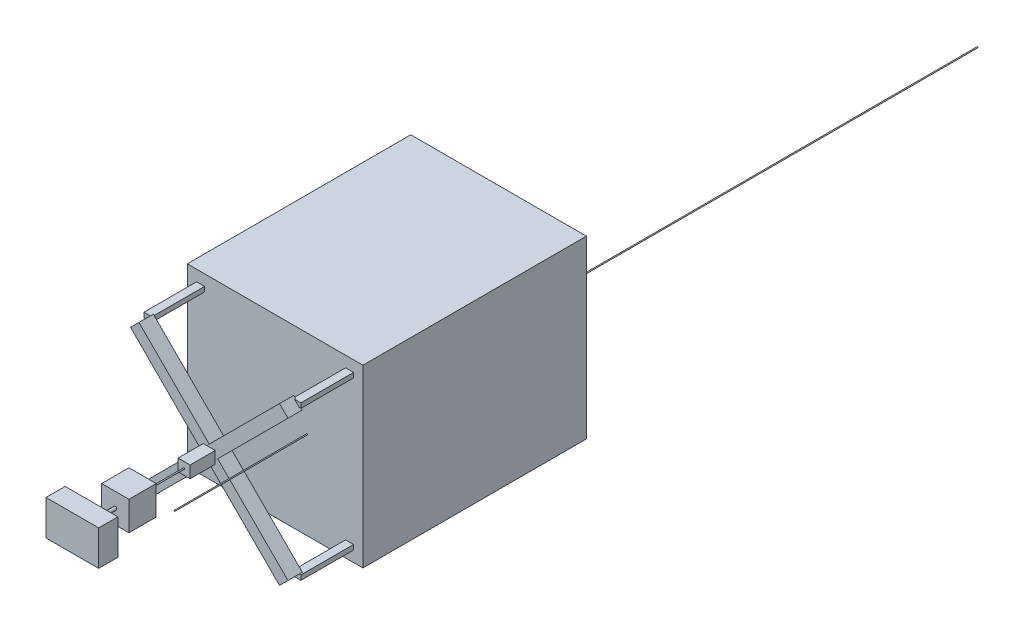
ISO-10303-21;
HEADER;
FILE_DESCRIPTION(('STEP AP214'),'2;1');
FILE_NAME('part.step','',(''),(''),'','','');
FILE_SCHEMA(('AUTOMOTIVE_DESIGN { 1 0 10303 214 1 1 1 1 }'));
ENDSEC;
DATA;
#1=APPLICATION_CONTEXT('core data for automotive mechanical design processes');
#2=APPLICATION_PROTOCOL_DEFINITION('international standard','automotive_design',2000,#1);
#3=PRODUCT_CONTEXT('',#1,'mechanical');
#4=PRODUCT('Part','Part','',(#3));
#5=PRODUCT_RELATED_PRODUCT_CATEGORY('part','',(#4));
#6=PRODUCT_DEFINITION_FORMATION('','',#4);
#7=PRODUCT_DEFINITION_CONTEXT('part definition',#1,'design');
#8=PRODUCT_DEFINITION('design','',#6,#7);
#9=PRODUCT_DEFINITION_SHAPE('','',#8);
#10=(LENGTH_UNIT() NAMED_UNIT(*) SI_UNIT(.MILLI.,.METRE.));
#11=(NAMED_UNIT(*) PLANE_ANGLE_UNIT() SI_UNIT($,.RADIAN.));
#12=(NAMED_UNIT(*) SI_UNIT($,.STERADIAN.) SOLID_ANGLE_UNIT());
#13=UNCERTAINTY_MEASURE_WITH_UNIT(LENGTH_MEASURE(1.E-05),#10,'distance_accuracy_value','');
#14=(GEOMETRIC_REPRESENTATION_CONTEXT(3) GLOBAL_UNCERTAINTY_ASSIGNED_CONTEXT((#13)) GLOBAL_UNIT_ASSIGNED_CONTEXT((#10,
#11,#12)) REPRESENTATION_CONTEXT('',''));
#15=CARTESIAN_POINT('',(0.,0.,0.));
#16=DIRECTION('',(0.,0.,1.));
#17=DIRECTION('',(1.,0.,0.));
#18=AXIS2_PLACEMENT_3D('',#15,#16,#17);
#19=CARTESIAN_POINT('',(5500.,-1000.,6670.));
#20=DIRECTION('',(0.,0.,1.));
#21=DIRECTION('',(1.,0.,0.));
#22=AXIS2_PLACEMENT_3D('',#19,#20,#21);
#23=PLANE('',#22);
#24=DIRECTION('',(-1.,0.,0.));
#25=VECTOR('',#24,1.);
#26=CARTESIAN_POINT('',(5500.,-1110.,6670.));
#27=LINE('',#26,#25);
#28=CARTESIAN_POINT('',(5665.,-1110.,6670.));
#29=VERTEX_POINT('',#28);
#30=CARTESIAN_POINT('',(5335.,-1110.,6670.));
#31=VERTEX_POINT('',#30);
#32=EDGE_CURVE('P0_E10',#29,#31,#27,.T.);
#33=ORIENTED_EDGE('',*,*,#32,.F.);
#34=DIRECTION('',(0.,-1.,0.));
#35=VECTOR('',#34,1.);
#36=CARTESIAN_POINT('',(5665.,-1000.,6670.));
#37=LINE('',#36,#35);
#38=CARTESIAN_POINT('',(5665.,-890.,6670.));
#39=VERTEX_POINT('',#38);
#40=EDGE_CURVE('P0_E58',#39,#29,#37,.T.);
#41=ORIENTED_EDGE('',*,*,#40,.F.);
#42=DIRECTION('',(1.,0.,0.));
#43=VECTOR('',#42,1.);
#44=CARTESIAN_POINT('',(5500.,-890.,6670.));
#45=LINE('',#44,#43);
#46=CARTESIAN_POINT('',(5335.,-890.,6670.));
#47=VERTEX_POINT('',#46);
#48=EDGE_CURVE('P0_E88',#47,#39,#45,.T.);
#49=ORIENTED_EDGE('',*,*,#48,.F.);
#50=DIRECTION('',(0.,1.,0.));
#51=VECTOR('',#50,1.);
#52=CARTESIAN_POINT('',(5335.,-1000.,6670.));
#53=LINE('',#52,#51);
#54=EDGE_CURVE('P0_E23',#31,#47,#53,.T.);
#55=ORIENTED_EDGE('',*,*,#54,.F.);
#56=EDGE_LOOP('',(#33,#41,#49,#55));
#57=FACE_BOUND('',#56,.T.);
#58=ADVANCED_FACE('P0_F16',(#57),#23,.T.);
#59=CARTESIAN_POINT('',(5500.,-1110.,6550.));
#60=DIRECTION('',(0.,-1.,0.));
#61=DIRECTION('',(0.,0.,-1.));
#62=AXIS2_PLACEMENT_3D('',#59,#60,#61);
#63=PLANE('',#62);
#64=DIRECTION('',(0.,0.,1.));
#65=VECTOR('',#64,1.);
#66=CARTESIAN_POINT('',(5665.,-1110.,6550.));
#67=LINE('',#66,#65);
#68=CARTESIAN_POINT('',(5665.,-1110.,6550.));
#69=VERTEX_POINT('',#68);
#70=EDGE_CURVE('P0_E52',#69,#29,#67,.T.);
#71=ORIENTED_EDGE('',*,*,#70,.T.);
#72=ORIENTED_EDGE('',*,*,#32,.T.);
#73=DIRECTION('',(0.,0.,1.));
#74=VECTOR('',#73,1.);
#75=CARTESIAN_POINT('',(5335.,-1110.,6550.));
#76=LINE('',#75,#74);
#77=CARTESIAN_POINT('',(5335.,-1110.,6550.));
#78=VERTEX_POINT('',#77);
#79=EDGE_CURVE('P0_E66',#78,#31,#76,.T.);
#80=ORIENTED_EDGE('',*,*,#79,.F.);
#81=DIRECTION('',(1.,0.,0.));
#82=VECTOR('',#81,1.);
#83=CARTESIAN_POINT('',(5500.,-1110.,6550.));
#84=LINE('',#83,#82);
#85=EDGE_CURVE('P0_E63',#78,#69,#84,.T.);
#86=ORIENTED_EDGE('',*,*,#85,.T.);
#87=EDGE_LOOP('',(#71,#72,#80,#86));
#88=FACE_BOUND('',#87,.T.);
#89=ADVANCED_FACE('P0_F65',(#88),#63,.T.);
#90=CARTESIAN_POINT('',(5335.,-1000.,6550.));
#91=DIRECTION('',(-1.,0.,0.));
#92=DIRECTION('',(0.,0.,1.));
#93=AXIS2_PLACEMENT_3D('',#90,#91,#92);
#94=PLANE('',#93);
#95=ORIENTED_EDGE('',*,*,#79,.T.);
#96=ORIENTED_EDGE('',*,*,#54,.T.);
#97=DIRECTION('',(0.,0.,1.));
#98=VECTOR('',#97,1.);
#99=CARTESIAN_POINT('',(5335.,-890.,6550.));
#100=LINE('',#99,#98);
#101=CARTESIAN_POINT('',(5335.,-890.,6550.));
#102=VERTEX_POINT('',#101);
#103=EDGE_CURVE('P0_E81',#102,#47,#100,.T.);
#104=ORIENTED_EDGE('',*,*,#103,.F.);
#105=DIRECTION('',(0.,-1.,0.));
#106=VECTOR('',#105,1.);
#107=CARTESIAN_POINT('',(5335.,-1000.,6550.));
#108=LINE('',#107,#106);
#109=EDGE_CURVE('P0_E69',#102,#78,#108,.T.);
#110=ORIENTED_EDGE('',*,*,#109,.T.);
#111=EDGE_LOOP('',(#95,#96,#104,#110));
#112=FACE_BOUND('',#111,.T.);
#113=ADVANCED_FACE('P0_F89',(#112),#94,.T.);
#114=CARTESIAN_POINT('',(5500.,-890.,6550.));
#115=DIRECTION('',(0.,1.,0.));
#116=DIRECTION('',(0.,0.,1.));
#117=AXIS2_PLACEMENT_3D('',#114,#115,#116);
#118=PLANE('',#117);
#119=ORIENTED_EDGE('',*,*,#103,.T.);
#120=ORIENTED_EDGE('',*,*,#48,.T.);
#121=DIRECTION('',(0.,0.,1.));
#122=VECTOR('',#121,1.);
#123=CARTESIAN_POINT('',(5665.,-890.,6550.));
#124=LINE('',#123,#122);
#125=CARTESIAN_POINT('',(5665.,-890.,6550.));
#126=VERTEX_POINT('',#125);
#127=EDGE_CURVE('P0_E61',#126,#39,#124,.T.);
#128=ORIENTED_EDGE('',*,*,#127,.F.);
#129=DIRECTION('',(-1.,0.,0.));
#130=VECTOR('',#129,1.);
#131=CARTESIAN_POINT('',(5500.,-890.,6550.));
#132=LINE('',#131,#130);
#133=EDGE_CURVE('P0_E74',#126,#102,#132,.T.);
#134=ORIENTED_EDGE('',*,*,#133,.T.);
#135=EDGE_LOOP('',(#119,#120,#128,#134));
#136=FACE_BOUND('',#135,.T.);
#137=ADVANCED_FACE('P0_F86',(#136),#118,.T.);
#138=CARTESIAN_POINT('',(5500.,-1000.,6550.));
#139=DIRECTION('',(0.,0.,-1.));
#140=DIRECTION('',(-1.,0.,0.));
#141=AXIS2_PLACEMENT_3D('',#138,#139,#140);
#142=PLANE('',#141);
#143=DIRECTION('',(0.,1.,0.));
#144=VECTOR('',#143,1.);
#145=CARTESIAN_POINT('',(5665.,-1000.,6550.));
#146=LINE('',#145,#144);
#147=EDGE_CURVE('P0_E59',#69,#126,#146,.T.);
#148=ORIENTED_EDGE('',*,*,#147,.F.);
#149=ORIENTED_EDGE('',*,*,#85,.F.);
#150=ORIENTED_EDGE('',*,*,#109,.F.);
#151=ORIENTED_EDGE('',*,*,#133,.F.);
#152=EDGE_LOOP('',(#148,#149,#150,#151));
#153=FACE_BOUND('',#152,.T.);
#154=ADVANCED_FACE('P0_F73',(#153),#142,.T.);
#155=CARTESIAN_POINT('',(5665.,-1000.,6550.));
#156=DIRECTION('',(1.,0.,0.));
#157=DIRECTION('',(0.,0.,-1.));
#158=AXIS2_PLACEMENT_3D('',#155,#156,#157);
#159=PLANE('',#158);
#160=ORIENTED_EDGE('',*,*,#147,.T.);
#161=ORIENTED_EDGE('',*,*,#127,.T.);
#162=ORIENTED_EDGE('',*,*,#40,.T.);
#163=ORIENTED_EDGE('',*,*,#70,.F.);
#164=EDGE_LOOP('',(#160,#161,#162,#163));
#165=FACE_BOUND('',#164,.T.);
#166=ADVANCED_FACE('P0_F54',(#165),#159,.T.);
#167=CLOSED_SHELL('',(#58,#89,#113,#137,#154,#166));
#168=MANIFOLD_SOLID_BREP('P0_B1',#167);
#169=CARTESIAN_POINT('',(5500.,-1000.,6401.));
#170=DIRECTION('',(0.,0.,1.));
#171=DIRECTION('',(1.,0.,0.));
#172=AXIS2_PLACEMENT_3D('',#169,#170,#171);
#173=PLANE('',#172);
#174=DIRECTION('',(-1.,0.,0.));
#175=VECTOR('',#174,1.);
#176=CARTESIAN_POINT('',(5500.,-1091.,6401.));
#177=LINE('',#176,#175);
#178=CARTESIAN_POINT('',(5585.5,-1091.,6401.));
#179=VERTEX_POINT('',#178);
#180=CARTESIAN_POINT('',(5414.5,-1091.,6401.));
#181=VERTEX_POINT('',#180);
#182=EDGE_CURVE('P1_E11',#179,#181,#177,.T.);
#183=ORIENTED_EDGE('',*,*,#182,.F.);
#184=DIRECTION('',(0.,-1.,0.));
#185=VECTOR('',#184,1.);
#186=CARTESIAN_POINT('',(5585.5,-1000.,6401.));
#187=LINE('',#186,#185);
#188=CARTESIAN_POINT('',(5585.5,-909.,6401.));
#189=VERTEX_POINT('',#188);
#190=EDGE_CURVE('P1_E61',#189,#179,#187,.T.);
#191=ORIENTED_EDGE('',*,*,#190,.F.);
#192=DIRECTION('',(1.,0.,0.));
#193=VECTOR('',#192,1.);
#194=CARTESIAN_POINT('',(5500.,-909.,6401.));
#195=LINE('',#194,#193);
#196=CARTESIAN_POINT('',(5414.5,-909.,6401.));
#197=VERTEX_POINT('',#196);
#198=EDGE_CURVE('P1_E87',#197,#189,#195,.T.);
#199=ORIENTED_EDGE('',*,*,#198,.F.);
#200=DIRECTION('',(0.,1.,0.));
#201=VECTOR('',#200,1.);
#202=CARTESIAN_POINT('',(5414.5,-1000.,6401.));
#203=LINE('',#202,#201);
#204=EDGE_CURVE('P1_E24',#181,#197,#203,.T.);
#205=ORIENTED_EDGE('',*,*,#204,.F.);
#206=EDGE_LOOP('',(#183,#191,#199,#205));
#207=FACE_BOUND('',#206,.T.);
#208=ADVANCED_FACE('P1_F17',(#207),#173,.T.);
#209=CARTESIAN_POINT('',(5500.,-1091.,6230.));
#210=DIRECTION('',(0.,-1.,0.));
#211=DIRECTION('',(0.,0.,-1.));
#212=AXIS2_PLACEMENT_3D('',#209,#210,#211);
#213=PLANE('',#212);
#214=DIRECTION('',(0.,0.,1.));
#215=VECTOR('',#214,1.);
#216=CARTESIAN_POINT('',(5585.5,-1091.,6230.));
#217=LINE('',#216,#215);
#218=CARTESIAN_POINT('',(5585.5,-1091.,6230.));
#219=VERTEX_POINT('',#218);
#220=EDGE_CURVE('P1_E53',#219,#179,#217,.T.);
#221=ORIENTED_EDGE('',*,*,#220,.T.);
#222=ORIENTED_EDGE('',*,*,#182,.T.);
#223=DIRECTION('',(0.,0.,1.));
#224=VECTOR('',#223,1.);
#225=CARTESIAN_POINT('',(5414.5,-1091.,6230.));
#226=LINE('',#225,#224);
#227=CARTESIAN_POINT('',(5414.5,-1091.,6230.));
#228=VERTEX_POINT('',#227);
#229=EDGE_CURVE('P1_E70',#228,#181,#226,.T.);
#230=ORIENTED_EDGE('',*,*,#229,.F.);
#231=DIRECTION('',(1.,0.,0.));
#232=VECTOR('',#231,1.);
#233=CARTESIAN_POINT('',(5500.,-1091.,6230.));
#234=LINE('',#233,#232);
#235=EDGE_CURVE('P1_E65',#228,#219,#234,.T.);
#236=ORIENTED_EDGE('',*,*,#235,.T.);
#237=EDGE_LOOP('',(#221,#222,#230,#236));
#238=FACE_BOUND('',#237,.T.);
#239=ADVANCED_FACE('P1_F66',(#238),#213,.T.);
#240=CARTESIAN_POINT('',(5414.5,-1000.,6230.));
#241=DIRECTION('',(-1.,0.,0.));
#242=DIRECTION('',(0.,0.,1.));
#243=AXIS2_PLACEMENT_3D('',#240,#241,#242);
#244=PLANE('',#243);
#245=ORIENTED_EDGE('',*,*,#229,.T.);
#246=ORIENTED_EDGE('',*,*,#204,.T.);
#247=DIRECTION('',(0.,0.,1.));
#248=VECTOR('',#247,1.);
#249=CARTESIAN_POINT('',(5414.5,-909.,6230.));
#250=LINE('',#249,#248);
#251=CARTESIAN_POINT('',(5414.5,-909.,6230.));
#252=VERTEX_POINT('',#251);
#253=EDGE_CURVE('P1_E85',#252,#197,#250,.T.);
#254=ORIENTED_EDGE('',*,*,#253,.F.);
#255=DIRECTION('',(0.,-1.,0.));
#256=VECTOR('',#255,1.);
#257=CARTESIAN_POINT('',(5414.5,-1000.,6230.));
#258=LINE('',#257,#256);
#259=EDGE_CURVE('P1_E75',#252,#228,#258,.T.);
#260=ORIENTED_EDGE('',*,*,#259,.T.);
#261=EDGE_LOOP('',(#245,#246,#254,#260));
#262=FACE_BOUND('',#261,.T.);
#263=ADVANCED_FACE('P1_F93',(#262),#244,.T.);
#264=CARTESIAN_POINT('',(5500.,-909.,6230.));
#265=DIRECTION('',(0.,1.,0.));
#266=DIRECTION('',(0.,0.,1.));
#267=AXIS2_PLACEMENT_3D('',#264,#265,#266);
#268=PLANE('',#267);
#269=ORIENTED_EDGE('',*,*,#253,.T.);
#270=ORIENTED_EDGE('',*,*,#198,.T.);
#271=DIRECTION('',(0.,0.,1.));
#272=VECTOR('',#271,1.);
#273=CARTESIAN_POINT('',(5585.5,-909.,6230.));
#274=LINE('',#273,#272);
#275=CARTESIAN_POINT('',(5585.5,-909.,6230.));
#276=VERTEX_POINT('',#275);
#277=EDGE_CURVE('P1_E62',#276,#189,#274,.T.);
#278=ORIENTED_EDGE('',*,*,#277,.F.);
#279=DIRECTION('',(-1.,0.,0.));
#280=VECTOR('',#279,1.);
#281=CARTESIAN_POINT('',(5500.,-909.,6230.));
#282=LINE('',#281,#280);
#283=EDGE_CURVE('P1_E76',#276,#252,#282,.T.);
#284=ORIENTED_EDGE('',*,*,#283,.T.);
#285=EDGE_LOOP('',(#269,#270,#278,#284));
#286=FACE_BOUND('',#285,.T.);
#287=ADVANCED_FACE('P1_F90',(#286),#268,.T.);
#288=CARTESIAN_POINT('',(5500.,-1000.,6230.));
#289=DIRECTION('',(0.,0.,-1.));
#290=DIRECTION('',(-1.,0.,0.));
#291=AXIS2_PLACEMENT_3D('',#288,#289,#290);
#292=PLANE('',#291);
#293=DIRECTION('',(0.,1.,0.));
#294=VECTOR('',#293,1.);
#295=CARTESIAN_POINT('',(5585.5,-1000.,6230.));
#296=LINE('',#295,#294);
#297=EDGE_CURVE('P1_E56',#219,#276,#296,.T.);
#298=ORIENTED_EDGE('',*,*,#297,.F.);
#299=ORIENTED_EDGE('',*,*,#235,.F.);
#300=ORIENTED_EDGE('',*,*,#259,.F.);
#301=ORIENTED_EDGE('',*,*,#283,.F.);
#302=EDGE_LOOP('',(#298,#299,#300,#301));
#303=FACE_BOUND('',#302,.T.);
#304=ADVANCED_FACE('P1_F72',(#303),#292,.T.);
#305=CARTESIAN_POINT('',(5585.5,-1000.,6230.));
#306=DIRECTION('',(1.,0.,0.));
#307=DIRECTION('',(0.,0.,-1.));
#308=AXIS2_PLACEMENT_3D('',#305,#306,#307);
#309=PLANE('',#308);
#310=ORIENTED_EDGE('',*,*,#297,.T.);
#311=ORIENTED_EDGE('',*,*,#277,.T.);
#312=ORIENTED_EDGE('',*,*,#190,.T.);
#313=ORIENTED_EDGE('',*,*,#220,.F.);
#314=EDGE_LOOP('',(#310,#311,#312,#313));
#315=FACE_BOUND('',#314,.T.);
#316=ADVANCED_FACE('P1_F57',(#315),#309,.T.);
#317=CLOSED_SHELL('',(#208,#239,#263,#287,#304,#316));
#318=MANIFOLD_SOLID_BREP('P1_B1',#317);
#319=CARTESIAN_POINT('',(5500.,-1000.,6550.));
#320=DIRECTION('',(0.,0.,1.));
#321=DIRECTION('',(1.,0.,0.));
#322=AXIS2_PLACEMENT_3D('',#319,#320,#321);
#323=PLANE('',#322);
#324=CARTESIAN_POINT('',(5500.,-1000.,6550.));
#325=DIRECTION('',(0.,0.,-1.));
#326=DIRECTION('',(-1.,0.,0.));
#327=AXIS2_PLACEMENT_3D('',#324,#325,#326);
#328=CIRCLE('',#327,10.);
#329=CARTESIAN_POINT('',(5490.,-1000.,6550.));
#330=VERTEX_POINT('',#329);
#331=EDGE_CURVE('P2_E10',#330,#330,#328,.T.);
#332=ORIENTED_EDGE('',*,*,#331,.F.);
#333=EDGE_LOOP('',(#332));
#334=FACE_BOUND('',#333,.T.);
#335=ADVANCED_FACE('P2_F15',(#334),#323,.T.);
#336=CARTESIAN_POINT('',(5500.,-1000.,6401.));
#337=DIRECTION('',(0.,0.,-1.));
#338=DIRECTION('',(-1.,0.,0.));
#339=AXIS2_PLACEMENT_3D('',#336,#337,#338);
#340=PLANE('',#339);
#341=CARTESIAN_POINT('',(5500.,-1000.,6401.));
#342=DIRECTION('',(0.,0.,1.));
#343=DIRECTION('',(1.,0.,0.));
#344=AXIS2_PLACEMENT_3D('',#341,#342,#343);
#345=CIRCLE('',#344,10.);
#346=CARTESIAN_POINT('',(5510.,-1000.,6401.));
#347=VERTEX_POINT('',#346);
#348=EDGE_CURVE('P2_E22',#347,#347,#345,.T.);
#349=ORIENTED_EDGE('',*,*,#348,.F.);
#350=EDGE_LOOP('',(#349));
#351=FACE_BOUND('',#350,.T.);
#352=ADVANCED_FACE('P2_F26',(#351),#340,.T.);
#353=CARTESIAN_POINT('',(5500.,-1000.,6401.));
#354=DIRECTION('',(0.,0.,1.));
#355=DIRECTION('',(1.,0.,0.));
#356=AXIS2_PLACEMENT_3D('',#353,#354,#355);
#357=CYLINDRICAL_SURFACE('',#356,10.);
#358=ORIENTED_EDGE('',*,*,#331,.T.);
#359=EDGE_LOOP('',(#358));
#360=FACE_BOUND('',#359,.T.);
#361=ORIENTED_EDGE('',*,*,#348,.T.);
#362=EDGE_LOOP('',(#361));
#363=FACE_BOUND('',#362,.T.);
#364=ADVANCED_FACE('P2_F17',(#360,#363),#357,.T.);
#365=CLOSED_SHELL('',(#335,#352,#364));
#366=MANIFOLD_SOLID_BREP('P2_B1',#365);
#367=CARTESIAN_POINT('',(5500.,-1000.,6230.));
#368=DIRECTION('',(0.,0.,1.));
#369=DIRECTION('',(1.,0.,0.));
#370=AXIS2_PLACEMENT_3D('',#367,#368,#369);
#371=PLANE('',#370);
#372=CARTESIAN_POINT('',(5500.,-1000.,6230.));
#373=DIRECTION('',(0.,0.,-1.));
#374=DIRECTION('',(-1.,0.,0.));
#375=AXIS2_PLACEMENT_3D('',#372,#373,#374);
#376=CIRCLE('',#375,3.55);
#377=CARTESIAN_POINT('',(5496.45,-1000.,6230.));
#378=VERTEX_POINT('',#377);
#379=EDGE_CURVE('P3_E10',#378,#378,#376,.T.);
#380=ORIENTED_EDGE('',*,*,#379,.F.);
#381=EDGE_LOOP('',(#380));
#382=FACE_BOUND('',#381,.T.);
#383=ADVANCED_FACE('P3_F15',(#382),#371,.T.);
#384=CARTESIAN_POINT('',(5500.,-1000.,5970.));
#385=DIRECTION('',(0.,0.,-1.));
#386=DIRECTION('',(-1.,0.,0.));
#387=AXIS2_PLACEMENT_3D('',#384,#385,#386);
#388=PLANE('',#387);
#389=CARTESIAN_POINT('',(5500.,-1000.,5970.));
#390=DIRECTION('',(0.,0.,1.));
#391=DIRECTION('',(1.,0.,0.));
#392=AXIS2_PLACEMENT_3D('',#389,#390,#391);
#393=CIRCLE('',#392,3.55);
#394=CARTESIAN_POINT('',(5503.55,-1000.,5970.));
#395=VERTEX_POINT('',#394);
#396=EDGE_CURVE('P3_E22',#395,#395,#393,.T.);
#397=ORIENTED_EDGE('',*,*,#396,.F.);
#398=EDGE_LOOP('',(#397));
#399=FACE_BOUND('',#398,.T.);
#400=ADVANCED_FACE('P3_F26',(#399),#388,.T.);
#401=CARTESIAN_POINT('',(5500.,-1000.,5970.));
#402=DIRECTION('',(0.,0.,1.));
#403=DIRECTION('',(1.,0.,0.));
#404=AXIS2_PLACEMENT_3D('',#401,#402,#403);
#405=CYLINDRICAL_SURFACE('',#404,3.55);
#406=ORIENTED_EDGE('',*,*,#379,.T.);
#407=EDGE_LOOP('',(#406));
#408=FACE_BOUND('',#407,.T.);
#409=ORIENTED_EDGE('',*,*,#396,.T.);
#410=EDGE_LOOP('',(#409));
#411=FACE_BOUND('',#410,.T.);
#412=ADVANCED_FACE('P3_F17',(#408,#411),#405,.T.);
#413=CLOSED_SHELL('',(#383,#400,#412));
#414=MANIFOLD_SOLID_BREP('P3_B1',#413);
#415=CARTESIAN_POINT('',(5966.69047558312,-1466.69047558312,5767.5));
#416=DIRECTION('',(0.707106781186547,-0.707106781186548,0.));
#417=DIRECTION('',(0.,0.,1.));
#418=AXIS2_PLACEMENT_3D('',#415,#416,#417);
#419=PLANE('',#418);
#420=DIRECTION('',(0.,0.,-1.));
#421=VECTOR('',#420,1.);
#422=CARTESIAN_POINT('',(5993.20697987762,-1440.17397128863,5767.5));
#423=LINE('',#422,#421);
#424=CARTESIAN_POINT('',(5993.20697987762,-1440.17397128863,5812.5));
#425=VERTEX_POINT('',#424);
#426=CARTESIAN_POINT('',(5993.20697987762,-1440.17397128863,5722.5));
#427=VERTEX_POINT('',#426);
#428=EDGE_CURVE('P4_E11',#425,#427,#423,.T.);
#429=ORIENTED_EDGE('',*,*,#428,.F.);
#430=DIRECTION('',(0.707106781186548,0.707106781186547,0.));
#431=VECTOR('',#430,1.);
#432=CARTESIAN_POINT('',(5966.69047558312,-1466.69047558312,5812.5));
#433=LINE('',#432,#431);
#434=CARTESIAN_POINT('',(5940.17397128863,-1493.20697987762,5812.5));
#435=VERTEX_POINT('',#434);
#436=EDGE_CURVE('P4_E61',#435,#425,#433,.T.);
#437=ORIENTED_EDGE('',*,*,#436,.F.);
#438=DIRECTION('',(0.,0.,1.));
#439=VECTOR('',#438,1.);
#440=CARTESIAN_POINT('',(5940.17397128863,-1493.20697987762,5767.5));
#441=LINE('',#440,#439);
#442=CARTESIAN_POINT('',(5940.17397128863,-1493.20697987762,5722.5));
#443=VERTEX_POINT('',#442);
#444=EDGE_CURVE('P4_E87',#443,#435,#441,.T.);
#445=ORIENTED_EDGE('',*,*,#444,.F.);
#446=DIRECTION('',(-0.707106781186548,-0.707106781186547,0.));
#447=VECTOR('',#446,1.);
#448=CARTESIAN_POINT('',(5966.69047558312,-1466.69047558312,5722.5));
#449=LINE('',#448,#447);
#450=EDGE_CURVE('P4_E24',#427,#443,#449,.T.);
#451=ORIENTED_EDGE('',*,*,#450,.F.);
#452=EDGE_LOOP('',(#429,#437,#445,#451));
#453=FACE_BOUND('',#452,.T.);
#454=ADVANCED_FACE('P4_F17',(#453),#419,.T.);
#455=CARTESIAN_POINT('',(5059.82602871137,-506.793020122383,5767.5));
#456=DIRECTION('',(0.707106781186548,0.707106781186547,0.));
#457=DIRECTION('',(-0.707106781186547,0.707106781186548,0.));
#458=AXIS2_PLACEMENT_3D('',#455,#456,#457);
#459=PLANE('',#458);
#460=DIRECTION('',(0.707106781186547,-0.707106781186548,0.));
#461=VECTOR('',#460,1.);
#462=CARTESIAN_POINT('',(5059.82602871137,-506.793020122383,5812.5));
#463=LINE('',#462,#461);
#464=CARTESIAN_POINT('',(5059.82602871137,-506.793020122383,5812.5));
#465=VERTEX_POINT('',#464);
#466=EDGE_CURVE('P4_E53',#465,#425,#463,.T.);
#467=ORIENTED_EDGE('',*,*,#466,.T.);
#468=ORIENTED_EDGE('',*,*,#428,.T.);
#469=DIRECTION('',(0.707106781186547,-0.707106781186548,0.));
#470=VECTOR('',#469,1.);
#471=CARTESIAN_POINT('',(5059.82602871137,-506.793020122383,5722.5));
#472=LINE('',#471,#470);
#473=CARTESIAN_POINT('',(5059.82602871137,-506.793020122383,5722.5));
#474=VERTEX_POINT('',#473);
#475=EDGE_CURVE('P4_E70',#474,#427,#472,.T.);
#476=ORIENTED_EDGE('',*,*,#475,.F.);
#477=DIRECTION('',(0.,0.,1.));
#478=VECTOR('',#477,1.);
#479=CARTESIAN_POINT('',(5059.82602871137,-506.793020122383,5767.5));
#480=LINE('',#479,#478);
#481=EDGE_CURVE('P4_E65',#474,#465,#480,.T.);
#482=ORIENTED_EDGE('',*,*,#481,.T.);
#483=EDGE_LOOP('',(#467,#468,#476,#482));
#484=FACE_BOUND('',#483,.T.);
#485=ADVANCED_FACE('P4_F66',(#484),#459,.T.);
#486=CARTESIAN_POINT('',(5033.30952441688,-533.309524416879,5722.5));
#487=DIRECTION('',(0.,0.,-1.));
#488=DIRECTION('',(0.707106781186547,-0.707106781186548,0.));
#489=AXIS2_PLACEMENT_3D('',#486,#487,#488);
#490=PLANE('',#489);
#491=ORIENTED_EDGE('',*,*,#475,.T.);
#492=ORIENTED_EDGE('',*,*,#450,.T.);
#493=DIRECTION('',(0.707106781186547,-0.707106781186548,0.));
#494=VECTOR('',#493,1.);
#495=CARTESIAN_POINT('',(5006.79302012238,-559.826028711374,5722.5));
#496=LINE('',#495,#494);
#497=CARTESIAN_POINT('',(5006.79302012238,-559.826028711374,5722.5));
#498=VERTEX_POINT('',#497);
#499=EDGE_CURVE('P4_E85',#498,#443,#496,.T.);
#500=ORIENTED_EDGE('',*,*,#499,.F.);
#501=DIRECTION('',(0.707106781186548,0.707106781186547,0.));
#502=VECTOR('',#501,1.);
#503=CARTESIAN_POINT('',(5033.30952441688,-533.309524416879,5722.5));
#504=LINE('',#503,#502);
#505=EDGE_CURVE('P4_E75',#498,#474,#504,.T.);
#506=ORIENTED_EDGE('',*,*,#505,.T.);
#507=EDGE_LOOP('',(#491,#492,#500,#506));
#508=FACE_BOUND('',#507,.T.);
#509=ADVANCED_FACE('P4_F93',(#508),#490,.T.);
#510=CARTESIAN_POINT('',(5006.79302012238,-559.826028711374,5767.5));
#511=DIRECTION('',(-0.707106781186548,-0.707106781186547,0.));
#512=DIRECTION('',(0.707106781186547,-0.707106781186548,0.));
#513=AXIS2_PLACEMENT_3D('',#510,#511,#512);
#514=PLANE('',#513);
#515=ORIENTED_EDGE('',*,*,#499,.T.);
#516=ORIENTED_EDGE('',*,*,#444,.T.);
#517=DIRECTION('',(0.707106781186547,-0.707106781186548,0.));
#518=VECTOR('',#517,1.);
#519=CARTESIAN_POINT('',(5006.79302012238,-559.826028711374,5812.5));
#520=LINE('',#519,#518);
#521=CARTESIAN_POINT('',(5006.79302012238,-559.826028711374,5812.5));
#522=VERTEX_POINT('',#521);
#523=EDGE_CURVE('P4_E62',#522,#435,#520,.T.);
#524=ORIENTED_EDGE('',*,*,#523,.F.);
#525=DIRECTION('',(0.,0.,-1.));
#526=VECTOR('',#525,1.);
#527=CARTESIAN_POINT('',(5006.79302012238,-559.826028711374,5767.5));
#528=LINE('',#527,#526);
#529=EDGE_CURVE('P4_E76',#522,#498,#528,.T.);
#530=ORIENTED_EDGE('',*,*,#529,.T.);
#531=EDGE_LOOP('',(#515,#516,#524,#530));
#532=FACE_BOUND('',#531,.T.);
#533=ADVANCED_FACE('P4_F90',(#532),#514,.T.);
#534=CARTESIAN_POINT('',(5033.30952441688,-533.309524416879,5767.5));
#535=DIRECTION('',(-0.707106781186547,0.707106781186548,0.));
#536=DIRECTION('',(0.,0.,-1.));
#537=AXIS2_PLACEMENT_3D('',#534,#535,#536);
#538=PLANE('',#537);
#539=DIRECTION('',(-0.707106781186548,-0.707106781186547,0.));
#540=VECTOR('',#539,1.);
#541=CARTESIAN_POINT('',(5033.30952441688,-533.309524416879,5812.5));
#542=LINE('',#541,#540);
#543=EDGE_CURVE('P4_E56',#465,#522,#542,.T.);
#544=ORIENTED_EDGE('',*,*,#543,.F.);
#545=ORIENTED_EDGE('',*,*,#481,.F.);
#546=ORIENTED_EDGE('',*,*,#505,.F.);
#547=ORIENTED_EDGE('',*,*,#529,.F.);
#548=EDGE_LOOP('',(#544,#545,#546,#547));
#549=FACE_BOUND('',#548,.T.);
#550=ADVANCED_FACE('P4_F72',(#549),#538,.T.);
#551=CARTESIAN_POINT('',(5033.30952441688,-533.309524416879,5812.5));
#552=DIRECTION('',(0.,0.,1.));
#553=DIRECTION('',(-0.707106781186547,0.707106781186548,0.));
#554=AXIS2_PLACEMENT_3D('',#551,#552,#553);
#555=PLANE('',#554);
#556=ORIENTED_EDGE('',*,*,#543,.T.);
#557=ORIENTED_EDGE('',*,*,#523,.T.);
#558=ORIENTED_EDGE('',*,*,#436,.T.);
#559=ORIENTED_EDGE('',*,*,#466,.F.);
#560=EDGE_LOOP('',(#556,#557,#558,#559));
#561=FACE_BOUND('',#560,.T.);
#562=ADVANCED_FACE('P4_F57',(#561),#555,.T.);
#563=CLOSED_SHELL('',(#454,#485,#509,#533,#550,#562));
#564=MANIFOLD_SOLID_BREP('P4_B1',#563);
#565=CARTESIAN_POINT('',(5966.69047558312,-533.309524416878,5767.5));
#566=DIRECTION('',(0.707106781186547,0.707106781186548,0.));
#567=DIRECTION('',(0.,0.,1.));
#568=AXIS2_PLACEMENT_3D('',#565,#566,#567);
#569=PLANE('',#568);
#570=DIRECTION('',(0.,0.,-1.));
#571=VECTOR('',#570,1.);
#572=CARTESIAN_POINT('',(5940.17397128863,-506.793020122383,5767.5));
#573=LINE('',#572,#571);
#574=CARTESIAN_POINT('',(5940.17397128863,-506.793020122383,5812.5));
#575=VERTEX_POINT('',#574);
#576=CARTESIAN_POINT('',(5940.17397128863,-506.793020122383,5722.5));
#577=VERTEX_POINT('',#576);
#578=EDGE_CURVE('P5_E11',#575,#577,#573,.T.);
#579=ORIENTED_EDGE('',*,*,#578,.F.);
#580=DIRECTION('',(-0.707106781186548,0.707106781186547,0.));
#581=VECTOR('',#580,1.);
#582=CARTESIAN_POINT('',(5966.69047558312,-533.309524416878,5812.5));
#583=LINE('',#582,#581);
#584=CARTESIAN_POINT('',(5993.20697987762,-559.826028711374,5812.5));
#585=VERTEX_POINT('',#584);
#586=EDGE_CURVE('P5_E61',#585,#575,#583,.T.);
#587=ORIENTED_EDGE('',*,*,#586,.F.);
#588=DIRECTION('',(0.,0.,1.));
#589=VECTOR('',#588,1.);
#590=CARTESIAN_POINT('',(5993.20697987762,-559.826028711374,5767.5));
#591=LINE('',#590,#589);
#592=CARTESIAN_POINT('',(5993.20697987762,-559.826028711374,5722.5));
#593=VERTEX_POINT('',#592);
#594=EDGE_CURVE('P5_E87',#593,#585,#591,.T.);
#595=ORIENTED_EDGE('',*,*,#594,.F.);
#596=DIRECTION('',(0.707106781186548,-0.707106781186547,0.));
#597=VECTOR('',#596,1.);
#598=CARTESIAN_POINT('',(5966.69047558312,-533.309524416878,5722.5));
#599=LINE('',#598,#597);
#600=EDGE_CURVE('P5_E24',#577,#593,#599,.T.);
#601=ORIENTED_EDGE('',*,*,#600,.F.);
#602=EDGE_LOOP('',(#579,#587,#595,#601));
#603=FACE_BOUND('',#602,.T.);
#604=ADVANCED_FACE('P5_F17',(#603),#569,.T.);
#605=CARTESIAN_POINT('',(5006.79302012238,-1440.17397128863,5767.5));
#606=DIRECTION('',(-0.707106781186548,0.707106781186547,0.));
#607=DIRECTION('',(-0.707106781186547,-0.707106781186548,0.));
#608=AXIS2_PLACEMENT_3D('',#605,#606,#607);
#609=PLANE('',#608);
#610=DIRECTION('',(0.707106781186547,0.707106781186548,0.));
#611=VECTOR('',#610,1.);
#612=CARTESIAN_POINT('',(5006.79302012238,-1440.17397128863,5812.5));
#613=LINE('',#612,#611);
#614=CARTESIAN_POINT('',(5006.79302012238,-1440.17397128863,5812.5));
#615=VERTEX_POINT('',#614);
#616=EDGE_CURVE('P5_E53',#615,#575,#613,.T.);
#617=ORIENTED_EDGE('',*,*,#616,.T.);
#618=ORIENTED_EDGE('',*,*,#578,.T.);
#619=DIRECTION('',(0.707106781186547,0.707106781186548,0.));
#620=VECTOR('',#619,1.);
#621=CARTESIAN_POINT('',(5006.79302012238,-1440.17397128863,5722.5));
#622=LINE('',#621,#620);
#623=CARTESIAN_POINT('',(5006.79302012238,-1440.17397128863,5722.5));
#624=VERTEX_POINT('',#623);
#625=EDGE_CURVE('P5_E70',#624,#577,#622,.T.);
#626=ORIENTED_EDGE('',*,*,#625,.F.);
#627=DIRECTION('',(0.,0.,1.));
#628=VECTOR('',#627,1.);
#629=CARTESIAN_POINT('',(5006.79302012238,-1440.17397128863,5767.5));
#630=LINE('',#629,#628);
#631=EDGE_CURVE('P5_E65',#624,#615,#630,.T.);
#632=ORIENTED_EDGE('',*,*,#631,.T.);
#633=EDGE_LOOP('',(#617,#618,#626,#632));
#634=FACE_BOUND('',#633,.T.);
#635=ADVANCED_FACE('P5_F66',(#634),#609,.T.);
#636=CARTESIAN_POINT('',(5033.30952441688,-1466.69047558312,5722.5));
#637=DIRECTION('',(0.,0.,-1.));
#638=DIRECTION('',(0.707106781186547,0.707106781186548,0.));
#639=AXIS2_PLACEMENT_3D('',#636,#637,#638);
#640=PLANE('',#639);
#641=ORIENTED_EDGE('',*,*,#625,.T.);
#642=ORIENTED_EDGE('',*,*,#600,.T.);
#643=DIRECTION('',(0.707106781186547,0.707106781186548,0.));
#644=VECTOR('',#643,1.);
#645=CARTESIAN_POINT('',(5059.82602871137,-1493.20697987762,5722.5));
#646=LINE('',#645,#644);
#647=CARTESIAN_POINT('',(5059.82602871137,-1493.20697987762,5722.5));
#648=VERTEX_POINT('',#647);
#649=EDGE_CURVE('P5_E85',#648,#593,#646,.T.);
#650=ORIENTED_EDGE('',*,*,#649,.F.);
#651=DIRECTION('',(-0.707106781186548,0.707106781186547,0.));
#652=VECTOR('',#651,1.);
#653=CARTESIAN_POINT('',(5033.30952441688,-1466.69047558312,5722.5));
#654=LINE('',#653,#652);
#655=EDGE_CURVE('P5_E75',#648,#624,#654,.T.);
#656=ORIENTED_EDGE('',*,*,#655,.T.);
#657=EDGE_LOOP('',(#641,#642,#650,#656));
#658=FACE_BOUND('',#657,.T.);
#659=ADVANCED_FACE('P5_F93',(#658),#640,.T.);
#660=CARTESIAN_POINT('',(5059.82602871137,-1493.20697987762,5767.5));
#661=DIRECTION('',(0.707106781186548,-0.707106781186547,0.));
#662=DIRECTION('',(0.707106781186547,0.707106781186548,0.));
#663=AXIS2_PLACEMENT_3D('',#660,#661,#662);
#664=PLANE('',#663);
#665=ORIENTED_EDGE('',*,*,#649,.T.);
#666=ORIENTED_EDGE('',*,*,#594,.T.);
#667=DIRECTION('',(0.707106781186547,0.707106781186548,0.));
#668=VECTOR('',#667,1.);
#669=CARTESIAN_POINT('',(5059.82602871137,-1493.20697987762,5812.5));
#670=LINE('',#669,#668);
#671=CARTESIAN_POINT('',(5059.82602871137,-1493.20697987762,5812.5));
#672=VERTEX_POINT('',#671);
#673=EDGE_CURVE('P5_E62',#672,#585,#670,.T.);
#674=ORIENTED_EDGE('',*,*,#673,.F.);
#675=DIRECTION('',(0.,0.,-1.));
#676=VECTOR('',#675,1.);
#677=CARTESIAN_POINT('',(5059.82602871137,-1493.20697987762,5767.5));
#678=LINE('',#677,#676);
#679=EDGE_CURVE('P5_E76',#672,#648,#678,.T.);
#680=ORIENTED_EDGE('',*,*,#679,.T.);
#681=EDGE_LOOP('',(#665,#666,#674,#680));
#682=FACE_BOUND('',#681,.T.);
#683=ADVANCED_FACE('P5_F90',(#682),#664,.T.);
#684=CARTESIAN_POINT('',(5033.30952441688,-1466.69047558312,5767.5));
#685=DIRECTION('',(-0.707106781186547,-0.707106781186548,0.));
#686=DIRECTION('',(0.,0.,-1.));
#687=AXIS2_PLACEMENT_3D('',#684,#685,#686);
#688=PLANE('',#687);
#689=DIRECTION('',(0.707106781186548,-0.707106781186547,0.));
#690=VECTOR('',#689,1.);
#691=CARTESIAN_POINT('',(5033.30952441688,-1466.69047558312,5812.5));
#692=LINE('',#691,#690);
#693=EDGE_CURVE('P5_E56',#615,#672,#692,.T.);
#694=ORIENTED_EDGE('',*,*,#693,.F.);
#695=ORIENTED_EDGE('',*,*,#631,.F.);
#696=ORIENTED_EDGE('',*,*,#655,.F.);
#697=ORIENTED_EDGE('',*,*,#679,.F.);
#698=EDGE_LOOP('',(#694,#695,#696,#697));
#699=FACE_BOUND('',#698,.T.);
#700=ADVANCED_FACE('P5_F72',(#699),#688,.T.);
#701=CARTESIAN_POINT('',(5033.30952441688,-1466.69047558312,5812.5));
#702=DIRECTION('',(0.,0.,1.));
#703=DIRECTION('',(-0.707106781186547,-0.707106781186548,0.));
#704=AXIS2_PLACEMENT_3D('',#701,#702,#703);
#705=PLANE('',#704);
#706=ORIENTED_EDGE('',*,*,#693,.T.);
#707=ORIENTED_EDGE('',*,*,#673,.T.);
#708=ORIENTED_EDGE('',*,*,#586,.T.);
#709=ORIENTED_EDGE('',*,*,#616,.F.);
#710=EDGE_LOOP('',(#706,#707,#708,#709));
#711=FACE_BOUND('',#710,.T.);
#712=ADVANCED_FACE('P5_F57',(#711),#705,.T.);
#713=CLOSED_SHELL('',(#604,#635,#659,#683,#700,#712));
#714=MANIFOLD_SOLID_BREP('P5_B1',#713);
#715=CARTESIAN_POINT('',(5500.,-1000.,5970.));
#716=DIRECTION('',(0.,0.,1.));
#717=DIRECTION('',(1.,0.,0.));
#718=AXIS2_PLACEMENT_3D('',#715,#716,#717);
#719=PLANE('',#718);
#720=DIRECTION('',(-1.,0.,0.));
#721=VECTOR('',#720,1.);
#722=CARTESIAN_POINT('',(5500.,-1037.5,5970.));
#723=LINE('',#722,#721);
#724=CARTESIAN_POINT('',(5537.5,-1037.5,5970.));
#725=VERTEX_POINT('',#724);
#726=CARTESIAN_POINT('',(5462.5,-1037.5,5970.));
#727=VERTEX_POINT('',#726);
#728=EDGE_CURVE('P6_E11',#725,#727,#723,.T.);
#729=ORIENTED_EDGE('',*,*,#728,.F.);
#730=DIRECTION('',(0.,-1.,0.));
#731=VECTOR('',#730,1.);
#732=CARTESIAN_POINT('',(5537.5,-1000.,5970.));
#733=LINE('',#732,#731);
#734=CARTESIAN_POINT('',(5537.5,-962.5,5970.));
#735=VERTEX_POINT('',#734);
#736=EDGE_CURVE('P6_E61',#735,#725,#733,.T.);
#737=ORIENTED_EDGE('',*,*,#736,.F.);
#738=DIRECTION('',(1.,0.,0.));
#739=VECTOR('',#738,1.);
#740=CARTESIAN_POINT('',(5500.,-962.5,5970.));
#741=LINE('',#740,#739);
#742=CARTESIAN_POINT('',(5462.5,-962.5,5970.));
#743=VERTEX_POINT('',#742);
#744=EDGE_CURVE('P6_E87',#743,#735,#741,.T.);
#745=ORIENTED_EDGE('',*,*,#744,.F.);
#746=DIRECTION('',(0.,1.,0.));
#747=VECTOR('',#746,1.);
#748=CARTESIAN_POINT('',(5462.5,-1000.,5970.));
#749=LINE('',#748,#747);
#750=EDGE_CURVE('P6_E24',#727,#743,#749,.T.);
#751=ORIENTED_EDGE('',*,*,#750,.F.);
#752=EDGE_LOOP('',(#729,#737,#745,#751));
#753=FACE_BOUND('',#752,.T.);
#754=ADVANCED_FACE('P6_F17',(#753),#719,.T.);
#755=CARTESIAN_POINT('',(5500.,-1037.5,5805.));
#756=DIRECTION('',(0.,-1.,0.));
#757=DIRECTION('',(0.,0.,-1.));
#758=AXIS2_PLACEMENT_3D('',#755,#756,#757);
#759=PLANE('',#758);
#760=DIRECTION('',(0.,0.,1.));
#761=VECTOR('',#760,1.);
#762=CARTESIAN_POINT('',(5537.5,-1037.5,5805.));
#763=LINE('',#762,#761);
#764=CARTESIAN_POINT('',(5537.5,-1037.5,5805.));
#765=VERTEX_POINT('',#764);
#766=EDGE_CURVE('P6_E53',#765,#725,#763,.T.);
#767=ORIENTED_EDGE('',*,*,#766,.T.);
#768=ORIENTED_EDGE('',*,*,#728,.T.);
#769=DIRECTION('',(0.,0.,1.));
#770=VECTOR('',#769,1.);
#771=CARTESIAN_POINT('',(5462.5,-1037.5,5805.));
#772=LINE('',#771,#770);
#773=CARTESIAN_POINT('',(5462.5,-1037.5,5805.));
#774=VERTEX_POINT('',#773);
#775=EDGE_CURVE('P6_E70',#774,#727,#772,.T.);
#776=ORIENTED_EDGE('',*,*,#775,.F.);
#777=DIRECTION('',(1.,0.,0.));
#778=VECTOR('',#777,1.);
#779=CARTESIAN_POINT('',(5500.,-1037.5,5805.));
#780=LINE('',#779,#778);
#781=EDGE_CURVE('P6_E65',#774,#765,#780,.T.);
#782=ORIENTED_EDGE('',*,*,#781,.T.);
#783=EDGE_LOOP('',(#767,#768,#776,#782));
#784=FACE_BOUND('',#783,.T.);
#785=ADVANCED_FACE('P6_F66',(#784),#759,.T.);
#786=CARTESIAN_POINT('',(5462.5,-1000.,5805.));
#787=DIRECTION('',(-1.,0.,0.));
#788=DIRECTION('',(0.,0.,1.));
#789=AXIS2_PLACEMENT_3D('',#786,#787,#788);
#790=PLANE('',#789);
#791=ORIENTED_EDGE('',*,*,#775,.T.);
#792=ORIENTED_EDGE('',*,*,#750,.T.);
#793=DIRECTION('',(0.,0.,1.));
#794=VECTOR('',#793,1.);
#795=CARTESIAN_POINT('',(5462.5,-962.5,5805.));
#796=LINE('',#795,#794);
#797=CARTESIAN_POINT('',(5462.5,-962.5,5805.));
#798=VERTEX_POINT('',#797);
#799=EDGE_CURVE('P6_E85',#798,#743,#796,.T.);
#800=ORIENTED_EDGE('',*,*,#799,.F.);
#801=DIRECTION('',(0.,-1.,0.));
#802=VECTOR('',#801,1.);
#803=CARTESIAN_POINT('',(5462.5,-1000.,5805.));
#804=LINE('',#803,#802);
#805=EDGE_CURVE('P6_E75',#798,#774,#804,.T.);
#806=ORIENTED_EDGE('',*,*,#805,.T.);
#807=EDGE_LOOP('',(#791,#792,#800,#806));
#808=FACE_BOUND('',#807,.T.);
#809=ADVANCED_FACE('P6_F93',(#808),#790,.T.);
#810=CARTESIAN_POINT('',(5500.,-962.5,5805.));
#811=DIRECTION('',(0.,1.,0.));
#812=DIRECTION('',(0.,0.,1.));
#813=AXIS2_PLACEMENT_3D('',#810,#811,#812);
#814=PLANE('',#813);
#815=ORIENTED_EDGE('',*,*,#799,.T.);
#816=ORIENTED_EDGE('',*,*,#744,.T.);
#817=DIRECTION('',(0.,0.,1.));
#818=VECTOR('',#817,1.);
#819=CARTESIAN_POINT('',(5537.5,-962.5,5805.));
#820=LINE('',#819,#818);
#821=CARTESIAN_POINT('',(5537.5,-962.5,5805.));
#822=VERTEX_POINT('',#821);
#823=EDGE_CURVE('P6_E62',#822,#735,#820,.T.);
#824=ORIENTED_EDGE('',*,*,#823,.F.);
#825=DIRECTION('',(-1.,0.,0.));
#826=VECTOR('',#825,1.);
#827=CARTESIAN_POINT('',(5500.,-962.5,5805.));
#828=LINE('',#827,#826);
#829=EDGE_CURVE('P6_E76',#822,#798,#828,.T.);
#830=ORIENTED_EDGE('',*,*,#829,.T.);
#831=EDGE_LOOP('',(#815,#816,#824,#830));
#832=FACE_BOUND('',#831,.T.);
#833=ADVANCED_FACE('P6_F90',(#832),#814,.T.);
#834=CARTESIAN_POINT('',(5500.,-1000.,5805.));
#835=DIRECTION('',(0.,0.,-1.));
#836=DIRECTION('',(-1.,0.,0.));
#837=AXIS2_PLACEMENT_3D('',#834,#835,#836);
#838=PLANE('',#837);
#839=DIRECTION('',(0.,1.,0.));
#840=VECTOR('',#839,1.);
#841=CARTESIAN_POINT('',(5537.5,-1000.,5805.));
#842=LINE('',#841,#840);
#843=EDGE_CURVE('P6_E56',#765,#822,#842,.T.);
#844=ORIENTED_EDGE('',*,*,#843,.F.);
#845=ORIENTED_EDGE('',*,*,#781,.F.);
#846=ORIENTED_EDGE('',*,*,#805,.F.);
#847=ORIENTED_EDGE('',*,*,#829,.F.);
#848=EDGE_LOOP('',(#844,#845,#846,#847));
#849=FACE_BOUND('',#848,.T.);
#850=ADVANCED_FACE('P6_F72',(#849),#838,.T.);
#851=CARTESIAN_POINT('',(5537.5,-1000.,5805.));
#852=DIRECTION('',(1.,0.,0.));
#853=DIRECTION('',(0.,0.,-1.));
#854=AXIS2_PLACEMENT_3D('',#851,#852,#853);
#855=PLANE('',#854);
#856=ORIENTED_EDGE('',*,*,#843,.T.);
#857=ORIENTED_EDGE('',*,*,#823,.T.);
#858=ORIENTED_EDGE('',*,*,#736,.T.);
#859=ORIENTED_EDGE('',*,*,#766,.F.);
#860=EDGE_LOOP('',(#856,#857,#858,#859));
#861=FACE_BOUND('',#860,.T.);
#862=ADVANCED_FACE('P6_F57',(#861),#855,.T.);
#863=CLOSED_SHELL('',(#754,#785,#809,#833,#850,#862));
#864=MANIFOLD_SOLID_BREP('P6_B1',#863);
#865=CARTESIAN_POINT('',(5500.,-1000.,5400.));
#866=DIRECTION('',(0.,0.,1.));
#867=DIRECTION('',(1.,0.,0.));
#868=AXIS2_PLACEMENT_3D('',#865,#866,#867);
#869=PLANE('',#868);
#870=DIRECTION('',(-1.,0.,0.));
#871=VECTOR('',#870,1.);
#872=CARTESIAN_POINT('',(5500.,-1550.,5400.));
#873=LINE('',#872,#871);
#874=CARTESIAN_POINT('',(6050.,-1550.,5400.));
#875=VERTEX_POINT('',#874);
#876=CARTESIAN_POINT('',(4950.,-1550.,5400.));
#877=VERTEX_POINT('',#876);
#878=EDGE_CURVE('P7_E11',#875,#877,#873,.T.);
#879=ORIENTED_EDGE('',*,*,#878,.F.);
#880=DIRECTION('',(0.,-1.,0.));
#881=VECTOR('',#880,1.);
#882=CARTESIAN_POINT('',(6050.,-1000.,5400.));
#883=LINE('',#882,#881);
#884=CARTESIAN_POINT('',(6050.,-450.,5400.));
#885=VERTEX_POINT('',#884);
#886=EDGE_CURVE('P7_E61',#885,#875,#883,.T.);
#887=ORIENTED_EDGE('',*,*,#886,.F.);
#888=DIRECTION('',(1.,0.,0.));
#889=VECTOR('',#888,1.);
#890=CARTESIAN_POINT('',(5500.,-450.,5400.));
#891=LINE('',#890,#889);
#892=CARTESIAN_POINT('',(4950.,-450.,5400.));
#893=VERTEX_POINT('',#892);
#894=EDGE_CURVE('P7_E87',#893,#885,#891,.T.);
#895=ORIENTED_EDGE('',*,*,#894,.F.);
#896=DIRECTION('',(0.,1.,0.));
#897=VECTOR('',#896,1.);
#898=CARTESIAN_POINT('',(4950.,-1000.,5400.));
#899=LINE('',#898,#897);
#900=EDGE_CURVE('P7_E24',#877,#893,#899,.T.);
#901=ORIENTED_EDGE('',*,*,#900,.F.);
#902=EDGE_LOOP('',(#879,#887,#895,#901));
#903=FACE_BOUND('',#902,.T.);
#904=ADVANCED_FACE('P7_F17',(#903),#869,.T.);
#905=CARTESIAN_POINT('',(5500.,-1550.,4000.));
#906=DIRECTION('',(0.,-1.,0.));
#907=DIRECTION('',(0.,0.,-1.));
#908=AXIS2_PLACEMENT_3D('',#905,#906,#907);
#909=PLANE('',#908);
#910=DIRECTION('',(0.,0.,1.));
#911=VECTOR('',#910,1.);
#912=CARTESIAN_POINT('',(6050.,-1550.,4000.));
#913=LINE('',#912,#911);
#914=CARTESIAN_POINT('',(6050.,-1550.,4000.));
#915=VERTEX_POINT('',#914);
#916=EDGE_CURVE('P7_E53',#915,#875,#913,.T.);
#917=ORIENTED_EDGE('',*,*,#916,.T.);
#918=ORIENTED_EDGE('',*,*,#878,.T.);
#919=DIRECTION('',(0.,0.,1.));
#920=VECTOR('',#919,1.);
#921=CARTESIAN_POINT('',(4950.,-1550.,4000.));
#922=LINE('',#921,#920);
#923=CARTESIAN_POINT('',(4950.,-1550.,4000.));
#924=VERTEX_POINT('',#923);
#925=EDGE_CURVE('P7_E70',#924,#877,#922,.T.);
#926=ORIENTED_EDGE('',*,*,#925,.F.);
#927=DIRECTION('',(1.,0.,0.));
#928=VECTOR('',#927,1.);
#929=CARTESIAN_POINT('',(5500.,-1550.,4000.));
#930=LINE('',#929,#928);
#931=EDGE_CURVE('P7_E65',#924,#915,#930,.T.);
#932=ORIENTED_EDGE('',*,*,#931,.T.);
#933=EDGE_LOOP('',(#917,#918,#926,#932));
#934=FACE_BOUND('',#933,.T.);
#935=ADVANCED_FACE('P7_F66',(#934),#909,.T.);
#936=CARTESIAN_POINT('',(4950.,-1000.,4000.));
#937=DIRECTION('',(-1.,0.,0.));
#938=DIRECTION('',(0.,0.,1.));
#939=AXIS2_PLACEMENT_3D('',#936,#937,#938);
#940=PLANE('',#939);
#941=ORIENTED_EDGE('',*,*,#925,.T.);
#942=ORIENTED_EDGE('',*,*,#900,.T.);
#943=DIRECTION('',(0.,0.,1.));
#944=VECTOR('',#943,1.);
#945=CARTESIAN_POINT('',(4950.,-450.,4000.));
#946=LINE('',#945,#944);
#947=CARTESIAN_POINT('',(4950.,-450.,4000.));
#948=VERTEX_POINT('',#947);
#949=EDGE_CURVE('P7_E85',#948,#893,#946,.T.);
#950=ORIENTED_EDGE('',*,*,#949,.F.);
#951=DIRECTION('',(0.,-1.,0.));
#952=VECTOR('',#951,1.);
#953=CARTESIAN_POINT('',(4950.,-1000.,4000.));
#954=LINE('',#953,#952);
#955=EDGE_CURVE('P7_E75',#948,#924,#954,.T.);
#956=ORIENTED_EDGE('',*,*,#955,.T.);
#957=EDGE_LOOP('',(#941,#942,#950,#956));
#958=FACE_BOUND('',#957,.T.);
#959=ADVANCED_FACE('P7_F93',(#958),#940,.T.);
#960=CARTESIAN_POINT('',(5500.,-450.,4000.));
#961=DIRECTION('',(0.,1.,0.));
#962=DIRECTION('',(0.,0.,1.));
#963=AXIS2_PLACEMENT_3D('',#960,#961,#962);
#964=PLANE('',#963);
#965=ORIENTED_EDGE('',*,*,#949,.T.);
#966=ORIENTED_EDGE('',*,*,#894,.T.);
#967=DIRECTION('',(0.,0.,1.));
#968=VECTOR('',#967,1.);
#969=CARTESIAN_POINT('',(6050.,-450.,4000.));
#970=LINE('',#969,#968);
#971=CARTESIAN_POINT('',(6050.,-450.,4000.));
#972=VERTEX_POINT('',#971);
#973=EDGE_CURVE('P7_E62',#972,#885,#970,.T.);
#974=ORIENTED_EDGE('',*,*,#973,.F.);
#975=DIRECTION('',(-1.,0.,0.));
#976=VECTOR('',#975,1.);
#977=CARTESIAN_POINT('',(5500.,-450.,4000.));
#978=LINE('',#977,#976);
#979=EDGE_CURVE('P7_E76',#972,#948,#978,.T.);
#980=ORIENTED_EDGE('',*,*,#979,.T.);
#981=EDGE_LOOP('',(#965,#966,#974,#980));
#982=FACE_BOUND('',#981,.T.);
#983=ADVANCED_FACE('P7_F90',(#982),#964,.T.);
#984=CARTESIAN_POINT('',(5500.,-1000.,4000.));
#985=DIRECTION('',(0.,0.,-1.));
#986=DIRECTION('',(-1.,0.,0.));
#987=AXIS2_PLACEMENT_3D('',#984,#985,#986);
#988=PLANE('',#987);
#989=DIRECTION('',(0.,1.,0.));
#990=VECTOR('',#989,1.);
#991=CARTESIAN_POINT('',(6050.,-1000.,4000.));
#992=LINE('',#991,#990);
#993=EDGE_CURVE('P7_E56',#915,#972,#992,.T.);
#994=ORIENTED_EDGE('',*,*,#993,.F.);
#995=ORIENTED_EDGE('',*,*,#931,.F.);
#996=ORIENTED_EDGE('',*,*,#955,.F.);
#997=ORIENTED_EDGE('',*,*,#979,.F.);
#998=EDGE_LOOP('',(#994,#995,#996,#997));
#999=FACE_BOUND('',#998,.T.);
#1000=ADVANCED_FACE('P7_F72',(#999),#988,.T.);
#1001=CARTESIAN_POINT('',(6050.,-1000.,4000.));
#1002=DIRECTION('',(1.,0.,0.));
#1003=DIRECTION('',(0.,0.,-1.));
#1004=AXIS2_PLACEMENT_3D('',#1001,#1002,#1003);
#1005=PLANE('',#1004);
#1006=ORIENTED_EDGE('',*,*,#993,.T.);
#1007=ORIENTED_EDGE('',*,*,#973,.T.);
#1008=ORIENTED_EDGE('',*,*,#886,.T.);
#1009=ORIENTED_EDGE('',*,*,#916,.F.);
#1010=EDGE_LOOP('',(#1006,#1007,#1008,#1009));
#1011=FACE_BOUND('',#1010,.T.);
#1012=ADVANCED_FACE('P7_F57',(#1011),#1005,.T.);
#1013=CLOSED_SHELL('',(#904,#935,#959,#983,#1000,#1012));
#1014=MANIFOLD_SOLID_BREP('P7_B1',#1013);
#1015=CARTESIAN_POINT('',(5033.30952441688,-1466.69047558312,5730.));
#1016=DIRECTION('',(0.,0.,1.));
#1017=DIRECTION('',(1.,0.,0.));
#1018=AXIS2_PLACEMENT_3D('',#1015,#1016,#1017);
#1019=PLANE('',#1018);
#1020=DIRECTION('',(-1.,0.,0.));
#1021=VECTOR('',#1020,1.);
#1022=CARTESIAN_POINT('',(5033.30952441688,-1481.69047558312,5730.));
#1023=LINE('',#1022,#1021);
#1024=CARTESIAN_POINT('',(5058.30952441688,-1481.69047558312,5730.));
#1025=VERTEX_POINT('',#1024);
#1026=CARTESIAN_POINT('',(5008.30952441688,-1481.69047558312,5730.));
#1027=VERTEX_POINT('',#1026);
#1028=EDGE_CURVE('P8_E11',#1025,#1027,#1023,.T.);
#1029=ORIENTED_EDGE('',*,*,#1028,.F.);
#1030=DIRECTION('',(0.,-1.,0.));
#1031=VECTOR('',#1030,1.);
#1032=CARTESIAN_POINT('',(5058.30952441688,-1466.69047558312,5730.));
#1033=LINE('',#1032,#1031);
#1034=CARTESIAN_POINT('',(5058.30952441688,-1451.69047558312,5730.));
#1035=VERTEX_POINT('',#1034);
#1036=EDGE_CURVE('P8_E61',#1035,#1025,#1033,.T.);
#1037=ORIENTED_EDGE('',*,*,#1036,.F.);
#1038=DIRECTION('',(1.,0.,0.));
#1039=VECTOR('',#1038,1.);
#1040=CARTESIAN_POINT('',(5033.30952441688,-1451.69047558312,5730.));
#1041=LINE('',#1040,#1039);
#1042=CARTESIAN_POINT('',(5008.30952441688,-1451.69047558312,5730.));
#1043=VERTEX_POINT('',#1042);
#1044=EDGE_CURVE('P8_E87',#1043,#1035,#1041,.T.);
#1045=ORIENTED_EDGE('',*,*,#1044,.F.);
#1046=DIRECTION('',(0.,1.,0.));
#1047=VECTOR('',#1046,1.);
#1048=CARTESIAN_POINT('',(5008.30952441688,-1466.69047558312,5730.));
#1049=LINE('',#1048,#1047);
#1050=EDGE_CURVE('P8_E24',#1027,#1043,#1049,.T.);
#1051=ORIENTED_EDGE('',*,*,#1050,.F.);
#1052=EDGE_LOOP('',(#1029,#1037,#1045,#1051));
#1053=FACE_BOUND('',#1052,.T.);
#1054=ADVANCED_FACE('P8_F17',(#1053),#1019,.T.);
#1055=CARTESIAN_POINT('',(5033.30952441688,-1481.69047558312,5400.));
#1056=DIRECTION('',(0.,-1.,0.));
#1057=DIRECTION('',(0.,0.,-1.));
#1058=AXIS2_PLACEMENT_3D('',#1055,#1056,#1057);
#1059=PLANE('',#1058);
#1060=DIRECTION('',(0.,0.,1.));
#1061=VECTOR('',#1060,1.);
#1062=CARTESIAN_POINT('',(5058.30952441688,-1481.69047558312,5400.));
#1063=LINE('',#1062,#1061);
#1064=CARTESIAN_POINT('',(5058.30952441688,-1481.69047558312,5400.));
#1065=VERTEX_POINT('',#1064);
#1066=EDGE_CURVE('P8_E53',#1065,#1025,#1063,.T.);
#1067=ORIENTED_EDGE('',*,*,#1066,.T.);
#1068=ORIENTED_EDGE('',*,*,#1028,.T.);
#1069=DIRECTION('',(0.,0.,1.));
#1070=VECTOR('',#1069,1.);
#1071=CARTESIAN_POINT('',(5008.30952441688,-1481.69047558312,5400.));
#1072=LINE('',#1071,#1070);
#1073=CARTESIAN_POINT('',(5008.30952441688,-1481.69047558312,5400.));
#1074=VERTEX_POINT('',#1073);
#1075=EDGE_CURVE('P8_E70',#1074,#1027,#1072,.T.);
#1076=ORIENTED_EDGE('',*,*,#1075,.F.);
#1077=DIRECTION('',(1.,0.,0.));
#1078=VECTOR('',#1077,1.);
#1079=CARTESIAN_POINT('',(5033.30952441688,-1481.69047558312,5400.));
#1080=LINE('',#1079,#1078);
#1081=EDGE_CURVE('P8_E65',#1074,#1065,#1080,.T.);
#1082=ORIENTED_EDGE('',*,*,#1081,.T.);
#1083=EDGE_LOOP('',(#1067,#1068,#1076,#1082));
#1084=FACE_BOUND('',#1083,.T.);
#1085=ADVANCED_FACE('P8_F66',(#1084),#1059,.T.);
#1086=CARTESIAN_POINT('',(5008.30952441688,-1466.69047558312,5400.));
#1087=DIRECTION('',(-1.,0.,0.));
#1088=DIRECTION('',(0.,0.,1.));
#1089=AXIS2_PLACEMENT_3D('',#1086,#1087,#1088);
#1090=PLANE('',#1089);
#1091=ORIENTED_EDGE('',*,*,#1075,.T.);
#1092=ORIENTED_EDGE('',*,*,#1050,.T.);
#1093=DIRECTION('',(0.,0.,1.));
#1094=VECTOR('',#1093,1.);
#1095=CARTESIAN_POINT('',(5008.30952441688,-1451.69047558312,5400.));
#1096=LINE('',#1095,#1094);
#1097=CARTESIAN_POINT('',(5008.30952441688,-1451.69047558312,5400.));
#1098=VERTEX_POINT('',#1097);
#1099=EDGE_CURVE('P8_E85',#1098,#1043,#1096,.T.);
#1100=ORIENTED_EDGE('',*,*,#1099,.F.);
#1101=DIRECTION('',(0.,-1.,0.));
#1102=VECTOR('',#1101,1.);
#1103=CARTESIAN_POINT('',(5008.30952441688,-1466.69047558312,5400.));
#1104=LINE('',#1103,#1102);
#1105=EDGE_CURVE('P8_E75',#1098,#1074,#1104,.T.);
#1106=ORIENTED_EDGE('',*,*,#1105,.T.);
#1107=EDGE_LOOP('',(#1091,#1092,#1100,#1106));
#1108=FACE_BOUND('',#1107,.T.);
#1109=ADVANCED_FACE('P8_F93',(#1108),#1090,.T.);
#1110=CARTESIAN_POINT('',(5033.30952441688,-1451.69047558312,5400.));
#1111=DIRECTION('',(0.,1.,0.));
#1112=DIRECTION('',(0.,0.,1.));
#1113=AXIS2_PLACEMENT_3D('',#1110,#1111,#1112);
#1114=PLANE('',#1113);
#1115=ORIENTED_EDGE('',*,*,#1099,.T.);
#1116=ORIENTED_EDGE('',*,*,#1044,.T.);
#1117=DIRECTION('',(0.,0.,1.));
#1118=VECTOR('',#1117,1.);
#1119=CARTESIAN_POINT('',(5058.30952441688,-1451.69047558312,5400.));
#1120=LINE('',#1119,#1118);
#1121=CARTESIAN_POINT('',(5058.30952441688,-1451.69047558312,5400.));
#1122=VERTEX_POINT('',#1121);
#1123=EDGE_CURVE('P8_E62',#1122,#1035,#1120,.T.);
#1124=ORIENTED_EDGE('',*,*,#1123,.F.);
#1125=DIRECTION('',(-1.,0.,0.));
#1126=VECTOR('',#1125,1.);
#1127=CARTESIAN_POINT('',(5033.30952441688,-1451.69047558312,5400.));
#1128=LINE('',#1127,#1126);
#1129=EDGE_CURVE('P8_E76',#1122,#1098,#1128,.T.);
#1130=ORIENTED_EDGE('',*,*,#1129,.T.);
#1131=EDGE_LOOP('',(#1115,#1116,#1124,#1130));
#1132=FACE_BOUND('',#1131,.T.);
#1133=ADVANCED_FACE('P8_F90',(#1132),#1114,.T.);
#1134=CARTESIAN_POINT('',(5033.30952441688,-1466.69047558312,5400.));
#1135=DIRECTION('',(0.,0.,-1.));
#1136=DIRECTION('',(-1.,0.,0.));
#1137=AXIS2_PLACEMENT_3D('',#1134,#1135,#1136);
#1138=PLANE('',#1137);
#1139=DIRECTION('',(0.,1.,0.));
#1140=VECTOR('',#1139,1.);
#1141=CARTESIAN_POINT('',(5058.30952441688,-1466.69047558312,5400.));
#1142=LINE('',#1141,#1140);
#1143=EDGE_CURVE('P8_E56',#1065,#1122,#1142,.T.);
#1144=ORIENTED_EDGE('',*,*,#1143,.F.);
#1145=ORIENTED_EDGE('',*,*,#1081,.F.);
#1146=ORIENTED_EDGE('',*,*,#1105,.F.);
#1147=ORIENTED_EDGE('',*,*,#1129,.F.);
#1148=EDGE_LOOP('',(#1144,#1145,#1146,#1147));
#1149=FACE_BOUND('',#1148,.T.);
#1150=ADVANCED_FACE('P8_F72',(#1149),#1138,.T.);
#1151=CARTESIAN_POINT('',(5058.30952441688,-1466.69047558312,5400.));
#1152=DIRECTION('',(1.,0.,0.));
#1153=DIRECTION('',(0.,0.,-1.));
#1154=AXIS2_PLACEMENT_3D('',#1151,#1152,#1153);
#1155=PLANE('',#1154);
#1156=ORIENTED_EDGE('',*,*,#1143,.T.);
#1157=ORIENTED_EDGE('',*,*,#1123,.T.);
#1158=ORIENTED_EDGE('',*,*,#1036,.T.);
#1159=ORIENTED_EDGE('',*,*,#1066,.F.);
#1160=EDGE_LOOP('',(#1156,#1157,#1158,#1159));
#1161=FACE_BOUND('',#1160,.T.);
#1162=ADVANCED_FACE('P8_F57',(#1161),#1155,.T.);
#1163=CLOSED_SHELL('',(#1054,#1085,#1109,#1133,#1150,#1162));
#1164=MANIFOLD_SOLID_BREP('P8_B1',#1163);
#1165=CARTESIAN_POINT('',(5033.30952441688,-533.309524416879,5730.));
#1166=DIRECTION('',(0.,0.,1.));
#1167=DIRECTION('',(1.,0.,0.));
#1168=AXIS2_PLACEMENT_3D('',#1165,#1166,#1167);
#1169=PLANE('',#1168);
#1170=DIRECTION('',(-1.,0.,0.));
#1171=VECTOR('',#1170,1.);
#1172=CARTESIAN_POINT('',(5033.30952441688,-548.309524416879,5730.));
#1173=LINE('',#1172,#1171);
#1174=CARTESIAN_POINT('',(5058.30952441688,-548.309524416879,5730.));
#1175=VERTEX_POINT('',#1174);
#1176=CARTESIAN_POINT('',(5008.30952441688,-548.309524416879,5730.));
#1177=VERTEX_POINT('',#1176);
#1178=EDGE_CURVE('P9_E11',#1175,#1177,#1173,.T.);
#1179=ORIENTED_EDGE('',*,*,#1178,.F.);
#1180=DIRECTION('',(0.,-1.,0.));
#1181=VECTOR('',#1180,1.);
#1182=CARTESIAN_POINT('',(5058.30952441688,-533.309524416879,5730.));
#1183=LINE('',#1182,#1181);
#1184=CARTESIAN_POINT('',(5058.30952441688,-518.309524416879,5730.));
#1185=VERTEX_POINT('',#1184);
#1186=EDGE_CURVE('P9_E61',#1185,#1175,#1183,.T.);
#1187=ORIENTED_EDGE('',*,*,#1186,.F.);
#1188=DIRECTION('',(1.,0.,0.));
#1189=VECTOR('',#1188,1.);
#1190=CARTESIAN_POINT('',(5033.30952441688,-518.309524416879,5730.));
#1191=LINE('',#1190,#1189);
#1192=CARTESIAN_POINT('',(5008.30952441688,-518.309524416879,5730.));
#1193=VERTEX_POINT('',#1192);
#1194=EDGE_CURVE('P9_E87',#1193,#1185,#1191,.T.);
#1195=ORIENTED_EDGE('',*,*,#1194,.F.);
#1196=DIRECTION('',(0.,1.,0.));
#1197=VECTOR('',#1196,1.);
#1198=CARTESIAN_POINT('',(5008.30952441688,-533.309524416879,5730.));
#1199=LINE('',#1198,#1197);
#1200=EDGE_CURVE('P9_E24',#1177,#1193,#1199,.T.);
#1201=ORIENTED_EDGE('',*,*,#1200,.F.);
#1202=EDGE_LOOP('',(#1179,#1187,#1195,#1201));
#1203=FACE_BOUND('',#1202,.T.);
#1204=ADVANCED_FACE('P9_F17',(#1203),#1169,.T.);
#1205=CARTESIAN_POINT('',(5033.30952441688,-548.309524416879,5400.));
#1206=DIRECTION('',(0.,-1.,0.));
#1207=DIRECTION('',(0.,0.,-1.));
#1208=AXIS2_PLACEMENT_3D('',#1205,#1206,#1207);
#1209=PLANE('',#1208);
#1210=DIRECTION('',(0.,0.,1.));
#1211=VECTOR('',#1210,1.);
#1212=CARTESIAN_POINT('',(5058.30952441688,-548.309524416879,5400.));
#1213=LINE('',#1212,#1211);
#1214=CARTESIAN_POINT('',(5058.30952441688,-548.309524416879,5400.));
#1215=VERTEX_POINT('',#1214);
#1216=EDGE_CURVE('P9_E53',#1215,#1175,#1213,.T.);
#1217=ORIENTED_EDGE('',*,*,#1216,.T.);
#1218=ORIENTED_EDGE('',*,*,#1178,.T.);
#1219=DIRECTION('',(0.,0.,1.));
#1220=VECTOR('',#1219,1.);
#1221=CARTESIAN_POINT('',(5008.30952441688,-548.309524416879,5400.));
#1222=LINE('',#1221,#1220);
#1223=CARTESIAN_POINT('',(5008.30952441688,-548.309524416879,5400.));
#1224=VERTEX_POINT('',#1223);
#1225=EDGE_CURVE('P9_E70',#1224,#1177,#1222,.T.);
#1226=ORIENTED_EDGE('',*,*,#1225,.F.);
#1227=DIRECTION('',(1.,0.,0.));
#1228=VECTOR('',#1227,1.);
#1229=CARTESIAN_POINT('',(5033.30952441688,-548.309524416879,5400.));
#1230=LINE('',#1229,#1228);
#1231=EDGE_CURVE('P9_E65',#1224,#1215,#1230,.T.);
#1232=ORIENTED_EDGE('',*,*,#1231,.T.);
#1233=EDGE_LOOP('',(#1217,#1218,#1226,#1232));
#1234=FACE_BOUND('',#1233,.T.);
#1235=ADVANCED_FACE('P9_F66',(#1234),#1209,.T.);
#1236=CARTESIAN_POINT('',(5008.30952441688,-533.309524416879,5400.));
#1237=DIRECTION('',(-1.,0.,0.));
#1238=DIRECTION('',(0.,0.,1.));
#1239=AXIS2_PLACEMENT_3D('',#1236,#1237,#1238);
#1240=PLANE('',#1239);
#1241=ORIENTED_EDGE('',*,*,#1225,.T.);
#1242=ORIENTED_EDGE('',*,*,#1200,.T.);
#1243=DIRECTION('',(0.,0.,1.));
#1244=VECTOR('',#1243,1.);
#1245=CARTESIAN_POINT('',(5008.30952441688,-518.309524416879,5400.));
#1246=LINE('',#1245,#1244);
#1247=CARTESIAN_POINT('',(5008.30952441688,-518.309524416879,5400.));
#1248=VERTEX_POINT('',#1247);
#1249=EDGE_CURVE('P9_E85',#1248,#1193,#1246,.T.);
#1250=ORIENTED_EDGE('',*,*,#1249,.F.);
#1251=DIRECTION('',(0.,-1.,0.));
#1252=VECTOR('',#1251,1.);
#1253=CARTESIAN_POINT('',(5008.30952441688,-533.309524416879,5400.));
#1254=LINE('',#1253,#1252);
#1255=EDGE_CURVE('P9_E75',#1248,#1224,#1254,.T.);
#1256=ORIENTED_EDGE('',*,*,#1255,.T.);
#1257=EDGE_LOOP('',(#1241,#1242,#1250,#1256));
#1258=FACE_BOUND('',#1257,.T.);
#1259=ADVANCED_FACE('P9_F93',(#1258),#1240,.T.);
#1260=CARTESIAN_POINT('',(5033.30952441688,-518.309524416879,5400.));
#1261=DIRECTION('',(0.,1.,0.));
#1262=DIRECTION('',(0.,0.,1.));
#1263=AXIS2_PLACEMENT_3D('',#1260,#1261,#1262);
#1264=PLANE('',#1263);
#1265=ORIENTED_EDGE('',*,*,#1249,.T.);
#1266=ORIENTED_EDGE('',*,*,#1194,.T.);
#1267=DIRECTION('',(0.,0.,1.));
#1268=VECTOR('',#1267,1.);
#1269=CARTESIAN_POINT('',(5058.30952441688,-518.309524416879,5400.));
#1270=LINE('',#1269,#1268);
#1271=CARTESIAN_POINT('',(5058.30952441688,-518.309524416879,5400.));
#1272=VERTEX_POINT('',#1271);
#1273=EDGE_CURVE('P9_E62',#1272,#1185,#1270,.T.);
#1274=ORIENTED_EDGE('',*,*,#1273,.F.);
#1275=DIRECTION('',(-1.,0.,0.));
#1276=VECTOR('',#1275,1.);
#1277=CARTESIAN_POINT('',(5033.30952441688,-518.309524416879,5400.));
#1278=LINE('',#1277,#1276);
#1279=EDGE_CURVE('P9_E76',#1272,#1248,#1278,.T.);
#1280=ORIENTED_EDGE('',*,*,#1279,.T.);
#1281=EDGE_LOOP('',(#1265,#1266,#1274,#1280));
#1282=FACE_BOUND('',#1281,.T.);
#1283=ADVANCED_FACE('P9_F90',(#1282),#1264,.T.);
#1284=CARTESIAN_POINT('',(5033.30952441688,-533.309524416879,5400.));
#1285=DIRECTION('',(0.,0.,-1.));
#1286=DIRECTION('',(-1.,0.,0.));
#1287=AXIS2_PLACEMENT_3D('',#1284,#1285,#1286);
#1288=PLANE('',#1287);
#1289=DIRECTION('',(0.,1.,0.));
#1290=VECTOR('',#1289,1.);
#1291=CARTESIAN_POINT('',(5058.30952441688,-533.309524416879,5400.));
#1292=LINE('',#1291,#1290);
#1293=EDGE_CURVE('P9_E56',#1215,#1272,#1292,.T.);
#1294=ORIENTED_EDGE('',*,*,#1293,.F.);
#1295=ORIENTED_EDGE('',*,*,#1231,.F.);
#1296=ORIENTED_EDGE('',*,*,#1255,.F.);
#1297=ORIENTED_EDGE('',*,*,#1279,.F.);
#1298=EDGE_LOOP('',(#1294,#1295,#1296,#1297));
#1299=FACE_BOUND('',#1298,.T.);
#1300=ADVANCED_FACE('P9_F72',(#1299),#1288,.T.);
#1301=CARTESIAN_POINT('',(5058.30952441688,-533.309524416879,5400.));
#1302=DIRECTION('',(1.,0.,0.));
#1303=DIRECTION('',(0.,0.,-1.));
#1304=AXIS2_PLACEMENT_3D('',#1301,#1302,#1303);
#1305=PLANE('',#1304);
#1306=ORIENTED_EDGE('',*,*,#1293,.T.);
#1307=ORIENTED_EDGE('',*,*,#1273,.T.);
#1308=ORIENTED_EDGE('',*,*,#1186,.T.);
#1309=ORIENTED_EDGE('',*,*,#1216,.F.);
#1310=EDGE_LOOP('',(#1306,#1307,#1308,#1309));
#1311=FACE_BOUND('',#1310,.T.);
#1312=ADVANCED_FACE('P9_F57',(#1311),#1305,.T.);
#1313=CLOSED_SHELL('',(#1204,#1235,#1259,#1283,#1300,#1312));
#1314=MANIFOLD_SOLID_BREP('P9_B1',#1313);
#1315=CARTESIAN_POINT('',(5966.69047558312,-1466.69047558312,5730.));
#1316=DIRECTION('',(0.,0.,1.));
#1317=DIRECTION('',(1.,0.,0.));
#1318=AXIS2_PLACEMENT_3D('',#1315,#1316,#1317);
#1319=PLANE('',#1318);
#1320=DIRECTION('',(-1.,0.,0.));
#1321=VECTOR('',#1320,1.);
#1322=CARTESIAN_POINT('',(5966.69047558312,-1481.69047558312,5730.));
#1323=LINE('',#1322,#1321);
#1324=CARTESIAN_POINT('',(5991.69047558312,-1481.69047558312,5730.));
#1325=VERTEX_POINT('',#1324);
#1326=CARTESIAN_POINT('',(5941.69047558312,-1481.69047558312,5730.));
#1327=VERTEX_POINT('',#1326);
#1328=EDGE_CURVE('P10_E11',#1325,#1327,#1323,.T.);
#1329=ORIENTED_EDGE('',*,*,#1328,.F.);
#1330=DIRECTION('',(0.,-1.,0.));
#1331=VECTOR('',#1330,1.);
#1332=CARTESIAN_POINT('',(5991.69047558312,-1466.69047558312,5730.));
#1333=LINE('',#1332,#1331);
#1334=CARTESIAN_POINT('',(5991.69047558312,-1451.69047558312,5730.));
#1335=VERTEX_POINT('',#1334);
#1336=EDGE_CURVE('P10_E61',#1335,#1325,#1333,.T.);
#1337=ORIENTED_EDGE('',*,*,#1336,.F.);
#1338=DIRECTION('',(1.,0.,0.));
#1339=VECTOR('',#1338,1.);
#1340=CARTESIAN_POINT('',(5966.69047558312,-1451.69047558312,5730.));
#1341=LINE('',#1340,#1339);
#1342=CARTESIAN_POINT('',(5941.69047558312,-1451.69047558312,5730.));
#1343=VERTEX_POINT('',#1342);
#1344=EDGE_CURVE('P10_E87',#1343,#1335,#1341,.T.);
#1345=ORIENTED_EDGE('',*,*,#1344,.F.);
#1346=DIRECTION('',(0.,1.,0.));
#1347=VECTOR('',#1346,1.);
#1348=CARTESIAN_POINT('',(5941.69047558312,-1466.69047558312,5730.));
#1349=LINE('',#1348,#1347);
#1350=EDGE_CURVE('P10_E24',#1327,#1343,#1349,.T.);
#1351=ORIENTED_EDGE('',*,*,#1350,.F.);
#1352=EDGE_LOOP('',(#1329,#1337,#1345,#1351));
#1353=FACE_BOUND('',#1352,.T.);
#1354=ADVANCED_FACE('P10_F17',(#1353),#1319,.T.);
#1355=CARTESIAN_POINT('',(5966.69047558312,-1481.69047558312,5400.));
#1356=DIRECTION('',(0.,-1.,0.));
#1357=DIRECTION('',(0.,0.,-1.));
#1358=AXIS2_PLACEMENT_3D('',#1355,#1356,#1357);
#1359=PLANE('',#1358);
#1360=DIRECTION('',(0.,0.,1.));
#1361=VECTOR('',#1360,1.);
#1362=CARTESIAN_POINT('',(5991.69047558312,-1481.69047558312,5400.));
#1363=LINE('',#1362,#1361);
#1364=CARTESIAN_POINT('',(5991.69047558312,-1481.69047558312,5400.));
#1365=VERTEX_POINT('',#1364);
#1366=EDGE_CURVE('P10_E53',#1365,#1325,#1363,.T.);
#1367=ORIENTED_EDGE('',*,*,#1366,.T.);
#1368=ORIENTED_EDGE('',*,*,#1328,.T.);
#1369=DIRECTION('',(0.,0.,1.));
#1370=VECTOR('',#1369,1.);
#1371=CARTESIAN_POINT('',(5941.69047558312,-1481.69047558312,5400.));
#1372=LINE('',#1371,#1370);
#1373=CARTESIAN_POINT('',(5941.69047558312,-1481.69047558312,5400.));
#1374=VERTEX_POINT('',#1373);
#1375=EDGE_CURVE('P10_E70',#1374,#1327,#1372,.T.);
#1376=ORIENTED_EDGE('',*,*,#1375,.F.);
#1377=DIRECTION('',(1.,0.,0.));
#1378=VECTOR('',#1377,1.);
#1379=CARTESIAN_POINT('',(5966.69047558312,-1481.69047558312,5400.));
#1380=LINE('',#1379,#1378);
#1381=EDGE_CURVE('P10_E65',#1374,#1365,#1380,.T.);
#1382=ORIENTED_EDGE('',*,*,#1381,.T.);
#1383=EDGE_LOOP('',(#1367,#1368,#1376,#1382));
#1384=FACE_BOUND('',#1383,.T.);
#1385=ADVANCED_FACE('P10_F66',(#1384),#1359,.T.);
#1386=CARTESIAN_POINT('',(5941.69047558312,-1466.69047558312,5400.));
#1387=DIRECTION('',(-1.,0.,0.));
#1388=DIRECTION('',(0.,0.,1.));
#1389=AXIS2_PLACEMENT_3D('',#1386,#1387,#1388);
#1390=PLANE('',#1389);
#1391=ORIENTED_EDGE('',*,*,#1375,.T.);
#1392=ORIENTED_EDGE('',*,*,#1350,.T.);
#1393=DIRECTION('',(0.,0.,1.));
#1394=VECTOR('',#1393,1.);
#1395=CARTESIAN_POINT('',(5941.69047558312,-1451.69047558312,5400.));
#1396=LINE('',#1395,#1394);
#1397=CARTESIAN_POINT('',(5941.69047558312,-1451.69047558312,5400.));
#1398=VERTEX_POINT('',#1397);
#1399=EDGE_CURVE('P10_E85',#1398,#1343,#1396,.T.);
#1400=ORIENTED_EDGE('',*,*,#1399,.F.);
#1401=DIRECTION('',(0.,-1.,0.));
#1402=VECTOR('',#1401,1.);
#1403=CARTESIAN_POINT('',(5941.69047558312,-1466.69047558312,5400.));
#1404=LINE('',#1403,#1402);
#1405=EDGE_CURVE('P10_E75',#1398,#1374,#1404,.T.);
#1406=ORIENTED_EDGE('',*,*,#1405,.T.);
#1407=EDGE_LOOP('',(#1391,#1392,#1400,#1406));
#1408=FACE_BOUND('',#1407,.T.);
#1409=ADVANCED_FACE('P10_F93',(#1408),#1390,.T.);
#1410=CARTESIAN_POINT('',(5966.69047558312,-1451.69047558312,5400.));
#1411=DIRECTION('',(0.,1.,0.));
#1412=DIRECTION('',(0.,0.,1.));
#1413=AXIS2_PLACEMENT_3D('',#1410,#1411,#1412);
#1414=PLANE('',#1413);
#1415=ORIENTED_EDGE('',*,*,#1399,.T.);
#1416=ORIENTED_EDGE('',*,*,#1344,.T.);
#1417=DIRECTION('',(0.,0.,1.));
#1418=VECTOR('',#1417,1.);
#1419=CARTESIAN_POINT('',(5991.69047558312,-1451.69047558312,5400.));
#1420=LINE('',#1419,#1418);
#1421=CARTESIAN_POINT('',(5991.69047558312,-1451.69047558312,5400.));
#1422=VERTEX_POINT('',#1421);
#1423=EDGE_CURVE('P10_E62',#1422,#1335,#1420,.T.);
#1424=ORIENTED_EDGE('',*,*,#1423,.F.);
#1425=DIRECTION('',(-1.,0.,0.));
#1426=VECTOR('',#1425,1.);
#1427=CARTESIAN_POINT('',(5966.69047558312,-1451.69047558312,5400.));
#1428=LINE('',#1427,#1426);
#1429=EDGE_CURVE('P10_E76',#1422,#1398,#1428,.T.);
#1430=ORIENTED_EDGE('',*,*,#1429,.T.);
#1431=EDGE_LOOP('',(#1415,#1416,#1424,#1430));
#1432=FACE_BOUND('',#1431,.T.);
#1433=ADVANCED_FACE('P10_F90',(#1432),#1414,.T.);
#1434=CARTESIAN_POINT('',(5966.69047558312,-1466.69047558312,5400.));
#1435=DIRECTION('',(0.,0.,-1.));
#1436=DIRECTION('',(-1.,0.,0.));
#1437=AXIS2_PLACEMENT_3D('',#1434,#1435,#1436);
#1438=PLANE('',#1437);
#1439=DIRECTION('',(0.,1.,0.));
#1440=VECTOR('',#1439,1.);
#1441=CARTESIAN_POINT('',(5991.69047558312,-1466.69047558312,5400.));
#1442=LINE('',#1441,#1440);
#1443=EDGE_CURVE('P10_E56',#1365,#1422,#1442,.T.);
#1444=ORIENTED_EDGE('',*,*,#1443,.F.);
#1445=ORIENTED_EDGE('',*,*,#1381,.F.);
#1446=ORIENTED_EDGE('',*,*,#1405,.F.);
#1447=ORIENTED_EDGE('',*,*,#1429,.F.);
#1448=EDGE_LOOP('',(#1444,#1445,#1446,#1447));
#1449=FACE_BOUND('',#1448,.T.);
#1450=ADVANCED_FACE('P10_F72',(#1449),#1438,.T.);
#1451=CARTESIAN_POINT('',(5991.69047558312,-1466.69047558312,5400.));
#1452=DIRECTION('',(1.,0.,0.));
#1453=DIRECTION('',(0.,0.,-1.));
#1454=AXIS2_PLACEMENT_3D('',#1451,#1452,#1453);
#1455=PLANE('',#1454);
#1456=ORIENTED_EDGE('',*,*,#1443,.T.);
#1457=ORIENTED_EDGE('',*,*,#1423,.T.);
#1458=ORIENTED_EDGE('',*,*,#1336,.T.);
#1459=ORIENTED_EDGE('',*,*,#1366,.F.);
#1460=EDGE_LOOP('',(#1456,#1457,#1458,#1459));
#1461=FACE_BOUND('',#1460,.T.);
#1462=ADVANCED_FACE('P10_F57',(#1461),#1455,.T.);
#1463=CLOSED_SHELL('',(#1354,#1385,#1409,#1433,#1450,#1462));
#1464=MANIFOLD_SOLID_BREP('P10_B1',#1463);
#1465=CARTESIAN_POINT('',(5966.69047558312,-533.309524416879,5730.));
#1466=DIRECTION('',(0.,0.,1.));
#1467=DIRECTION('',(1.,0.,0.));
#1468=AXIS2_PLACEMENT_3D('',#1465,#1466,#1467);
#1469=PLANE('',#1468);
#1470=DIRECTION('',(-1.,0.,0.));
#1471=VECTOR('',#1470,1.);
#1472=CARTESIAN_POINT('',(5966.69047558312,-548.309524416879,5730.));
#1473=LINE('',#1472,#1471);
#1474=CARTESIAN_POINT('',(5991.69047558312,-548.309524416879,5730.));
#1475=VERTEX_POINT('',#1474);
#1476=CARTESIAN_POINT('',(5941.69047558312,-548.309524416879,5730.));
#1477=VERTEX_POINT('',#1476);
#1478=EDGE_CURVE('P11_E11',#1475,#1477,#1473,.T.);
#1479=ORIENTED_EDGE('',*,*,#1478,.F.);
#1480=DIRECTION('',(0.,-1.,0.));
#1481=VECTOR('',#1480,1.);
#1482=CARTESIAN_POINT('',(5991.69047558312,-533.309524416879,5730.));
#1483=LINE('',#1482,#1481);
#1484=CARTESIAN_POINT('',(5991.69047558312,-518.309524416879,5730.));
#1485=VERTEX_POINT('',#1484);
#1486=EDGE_CURVE('P11_E61',#1485,#1475,#1483,.T.);
#1487=ORIENTED_EDGE('',*,*,#1486,.F.);
#1488=DIRECTION('',(1.,0.,0.));
#1489=VECTOR('',#1488,1.);
#1490=CARTESIAN_POINT('',(5966.69047558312,-518.309524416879,5730.));
#1491=LINE('',#1490,#1489);
#1492=CARTESIAN_POINT('',(5941.69047558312,-518.309524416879,5730.));
#1493=VERTEX_POINT('',#1492);
#1494=EDGE_CURVE('P11_E87',#1493,#1485,#1491,.T.);
#1495=ORIENTED_EDGE('',*,*,#1494,.F.);
#1496=DIRECTION('',(0.,1.,0.));
#1497=VECTOR('',#1496,1.);
#1498=CARTESIAN_POINT('',(5941.69047558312,-533.309524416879,5730.));
#1499=LINE('',#1498,#1497);
#1500=EDGE_CURVE('P11_E24',#1477,#1493,#1499,.T.);
#1501=ORIENTED_EDGE('',*,*,#1500,.F.);
#1502=EDGE_LOOP('',(#1479,#1487,#1495,#1501));
#1503=FACE_BOUND('',#1502,.T.);
#1504=ADVANCED_FACE('P11_F17',(#1503),#1469,.T.);
#1505=CARTESIAN_POINT('',(5966.69047558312,-548.309524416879,5400.));
#1506=DIRECTION('',(0.,-1.,0.));
#1507=DIRECTION('',(0.,0.,-1.));
#1508=AXIS2_PLACEMENT_3D('',#1505,#1506,#1507);
#1509=PLANE('',#1508);
#1510=DIRECTION('',(0.,0.,1.));
#1511=VECTOR('',#1510,1.);
#1512=CARTESIAN_POINT('',(5991.69047558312,-548.309524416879,5400.));
#1513=LINE('',#1512,#1511);
#1514=CARTESIAN_POINT('',(5991.69047558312,-548.309524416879,5400.));
#1515=VERTEX_POINT('',#1514);
#1516=EDGE_CURVE('P11_E53',#1515,#1475,#1513,.T.);
#1517=ORIENTED_EDGE('',*,*,#1516,.T.);
#1518=ORIENTED_EDGE('',*,*,#1478,.T.);
#1519=DIRECTION('',(0.,0.,1.));
#1520=VECTOR('',#1519,1.);
#1521=CARTESIAN_POINT('',(5941.69047558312,-548.309524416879,5400.));
#1522=LINE('',#1521,#1520);
#1523=CARTESIAN_POINT('',(5941.69047558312,-548.309524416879,5400.));
#1524=VERTEX_POINT('',#1523);
#1525=EDGE_CURVE('P11_E70',#1524,#1477,#1522,.T.);
#1526=ORIENTED_EDGE('',*,*,#1525,.F.);
#1527=DIRECTION('',(1.,0.,0.));
#1528=VECTOR('',#1527,1.);
#1529=CARTESIAN_POINT('',(5966.69047558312,-548.309524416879,5400.));
#1530=LINE('',#1529,#1528);
#1531=EDGE_CURVE('P11_E65',#1524,#1515,#1530,.T.);
#1532=ORIENTED_EDGE('',*,*,#1531,.T.);
#1533=EDGE_LOOP('',(#1517,#1518,#1526,#1532));
#1534=FACE_BOUND('',#1533,.T.);
#1535=ADVANCED_FACE('P11_F66',(#1534),#1509,.T.);
#1536=CARTESIAN_POINT('',(5941.69047558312,-533.309524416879,5400.));
#1537=DIRECTION('',(-1.,0.,0.));
#1538=DIRECTION('',(0.,0.,1.));
#1539=AXIS2_PLACEMENT_3D('',#1536,#1537,#1538);
#1540=PLANE('',#1539);
#1541=ORIENTED_EDGE('',*,*,#1525,.T.);
#1542=ORIENTED_EDGE('',*,*,#1500,.T.);
#1543=DIRECTION('',(0.,0.,1.));
#1544=VECTOR('',#1543,1.);
#1545=CARTESIAN_POINT('',(5941.69047558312,-518.309524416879,5400.));
#1546=LINE('',#1545,#1544);
#1547=CARTESIAN_POINT('',(5941.69047558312,-518.309524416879,5400.));
#1548=VERTEX_POINT('',#1547);
#1549=EDGE_CURVE('P11_E85',#1548,#1493,#1546,.T.);
#1550=ORIENTED_EDGE('',*,*,#1549,.F.);
#1551=DIRECTION('',(0.,-1.,0.));
#1552=VECTOR('',#1551,1.);
#1553=CARTESIAN_POINT('',(5941.69047558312,-533.309524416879,5400.));
#1554=LINE('',#1553,#1552);
#1555=EDGE_CURVE('P11_E75',#1548,#1524,#1554,.T.);
#1556=ORIENTED_EDGE('',*,*,#1555,.T.);
#1557=EDGE_LOOP('',(#1541,#1542,#1550,#1556));
#1558=FACE_BOUND('',#1557,.T.);
#1559=ADVANCED_FACE('P11_F93',(#1558),#1540,.T.);
#1560=CARTESIAN_POINT('',(5966.69047558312,-518.309524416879,5400.));
#1561=DIRECTION('',(0.,1.,0.));
#1562=DIRECTION('',(0.,0.,1.));
#1563=AXIS2_PLACEMENT_3D('',#1560,#1561,#1562);
#1564=PLANE('',#1563);
#1565=ORIENTED_EDGE('',*,*,#1549,.T.);
#1566=ORIENTED_EDGE('',*,*,#1494,.T.);
#1567=DIRECTION('',(0.,0.,1.));
#1568=VECTOR('',#1567,1.);
#1569=CARTESIAN_POINT('',(5991.69047558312,-518.309524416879,5400.));
#1570=LINE('',#1569,#1568);
#1571=CARTESIAN_POINT('',(5991.69047558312,-518.309524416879,5400.));
#1572=VERTEX_POINT('',#1571);
#1573=EDGE_CURVE('P11_E62',#1572,#1485,#1570,.T.);
#1574=ORIENTED_EDGE('',*,*,#1573,.F.);
#1575=DIRECTION('',(-1.,0.,0.));
#1576=VECTOR('',#1575,1.);
#1577=CARTESIAN_POINT('',(5966.69047558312,-518.309524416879,5400.));
#1578=LINE('',#1577,#1576);
#1579=EDGE_CURVE('P11_E76',#1572,#1548,#1578,.T.);
#1580=ORIENTED_EDGE('',*,*,#1579,.T.);
#1581=EDGE_LOOP('',(#1565,#1566,#1574,#1580));
#1582=FACE_BOUND('',#1581,.T.);
#1583=ADVANCED_FACE('P11_F90',(#1582),#1564,.T.);
#1584=CARTESIAN_POINT('',(5966.69047558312,-533.309524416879,5400.));
#1585=DIRECTION('',(0.,0.,-1.));
#1586=DIRECTION('',(-1.,0.,0.));
#1587=AXIS2_PLACEMENT_3D('',#1584,#1585,#1586);
#1588=PLANE('',#1587);
#1589=DIRECTION('',(0.,1.,0.));
#1590=VECTOR('',#1589,1.);
#1591=CARTESIAN_POINT('',(5991.69047558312,-533.309524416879,5400.));
#1592=LINE('',#1591,#1590);
#1593=EDGE_CURVE('P11_E56',#1515,#1572,#1592,.T.);
#1594=ORIENTED_EDGE('',*,*,#1593,.F.);
#1595=ORIENTED_EDGE('',*,*,#1531,.F.);
#1596=ORIENTED_EDGE('',*,*,#1555,.F.);
#1597=ORIENTED_EDGE('',*,*,#1579,.F.);
#1598=EDGE_LOOP('',(#1594,#1595,#1596,#1597));
#1599=FACE_BOUND('',#1598,.T.);
#1600=ADVANCED_FACE('P11_F72',(#1599),#1588,.T.);
#1601=CARTESIAN_POINT('',(5991.69047558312,-533.309524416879,5400.));
#1602=DIRECTION('',(1.,0.,0.));
#1603=DIRECTION('',(0.,0.,-1.));
#1604=AXIS2_PLACEMENT_3D('',#1601,#1602,#1603);
#1605=PLANE('',#1604);
#1606=ORIENTED_EDGE('',*,*,#1593,.T.);
#1607=ORIENTED_EDGE('',*,*,#1573,.T.);
#1608=ORIENTED_EDGE('',*,*,#1486,.T.);
#1609=ORIENTED_EDGE('',*,*,#1516,.F.);
#1610=EDGE_LOOP('',(#1606,#1607,#1608,#1609));
#1611=FACE_BOUND('',#1610,.T.);
#1612=ADVANCED_FACE('P11_F57',(#1611),#1605,.T.);
#1613=CLOSED_SHELL('',(#1504,#1535,#1559,#1583,#1600,#1612));
#1614=MANIFOLD_SOLID_BREP('P11_B1',#1613);
#1615=CARTESIAN_POINT('',(5500.,-1000.,4000.));
#1616=DIRECTION('',(0.,0.,1.));
#1617=DIRECTION('',(1.,0.,0.));
#1618=AXIS2_PLACEMENT_3D('',#1615,#1616,#1617);
#1619=PLANE('',#1618);
#1620=CARTESIAN_POINT('',(5500.,-1000.,4000.));
#1621=DIRECTION('',(0.,0.,-1.));
#1622=DIRECTION('',(-1.,0.,0.));
#1623=AXIS2_PLACEMENT_3D('',#1620,#1621,#1622);
#1624=CIRCLE('',#1623,150.);
#1625=CARTESIAN_POINT('',(5350.,-1000.,4000.));
#1626=VERTEX_POINT('',#1625);
#1627=EDGE_CURVE('P12_E10',#1626,#1626,#1624,.T.);
#1628=ORIENTED_EDGE('',*,*,#1627,.F.);
#1629=EDGE_LOOP('',(#1628));
#1630=FACE_BOUND('',#1629,.T.);
#1631=ADVANCED_FACE('P12_F15',(#1630),#1619,.T.);
#1632=CARTESIAN_POINT('',(5500.,-1000.,3750.));
#1633=DIRECTION('',(0.,0.,-1.));
#1634=DIRECTION('',(-1.,0.,0.));
#1635=AXIS2_PLACEMENT_3D('',#1632,#1633,#1634);
#1636=PLANE('',#1635);
#1637=CARTESIAN_POINT('',(5500.,-1000.,3750.));
#1638=DIRECTION('',(0.,0.,1.));
#1639=DIRECTION('',(1.,0.,0.));
#1640=AXIS2_PLACEMENT_3D('',#1637,#1638,#1639);
#1641=CIRCLE('',#1640,150.);
#1642=CARTESIAN_POINT('',(5650.,-1000.,3750.));
#1643=VERTEX_POINT('',#1642);
#1644=EDGE_CURVE('P12_E22',#1643,#1643,#1641,.T.);
#1645=ORIENTED_EDGE('',*,*,#1644,.F.);
#1646=EDGE_LOOP('',(#1645));
#1647=FACE_BOUND('',#1646,.T.);
#1648=ADVANCED_FACE('P12_F26',(#1647),#1636,.T.);
#1649=CARTESIAN_POINT('',(5500.,-1000.,3750.));
#1650=DIRECTION('',(0.,0.,1.));
#1651=DIRECTION('',(1.,0.,0.));
#1652=AXIS2_PLACEMENT_3D('',#1649,#1650,#1651);
#1653=CYLINDRICAL_SURFACE('',#1652,150.);
#1654=ORIENTED_EDGE('',*,*,#1627,.T.);
#1655=EDGE_LOOP('',(#1654));
#1656=FACE_BOUND('',#1655,.T.);
#1657=ORIENTED_EDGE('',*,*,#1644,.T.);
#1658=EDGE_LOOP('',(#1657));
#1659=FACE_BOUND('',#1658,.T.);
#1660=ADVANCED_FACE('P12_F17',(#1656,#1659),#1653,.T.);
#1661=CLOSED_SHELL('',(#1631,#1648,#1660));
#1662=MANIFOLD_SOLID_BREP('P12_B1',#1661);
#1663=CARTESIAN_POINT('',(5700.,-1000.,6230.));
#1664=DIRECTION('',(0.,0.,1.));
#1665=DIRECTION('',(1.,0.,0.));
#1666=AXIS2_PLACEMENT_3D('',#1663,#1664,#1665);
#1667=PLANE('',#1666);
#1668=CARTESIAN_POINT('',(5700.,-1000.,6230.));
#1669=DIRECTION('',(0.,0.,-1.));
#1670=DIRECTION('',(-1.,0.,0.));
#1671=AXIS2_PLACEMENT_3D('',#1668,#1669,#1670);
#1672=CIRCLE('',#1671,3.);
#1673=CARTESIAN_POINT('',(5697.,-1000.,6230.));
#1674=VERTEX_POINT('',#1673);
#1675=EDGE_CURVE('P13_E9',#1674,#1674,#1672,.T.);
#1676=ORIENTED_EDGE('',*,*,#1675,.F.);
#1677=EDGE_LOOP('',(#1676));
#1678=FACE_BOUND('',#1677,.T.);
#1679=ADVANCED_FACE('P13_F14',(#1678),#1667,.T.);
#1680=CARTESIAN_POINT('',(5700.,-1000.,1200.));
#1681=DIRECTION('',(0.,0.,-1.));
#1682=DIRECTION('',(-1.,0.,0.));
#1683=AXIS2_PLACEMENT_3D('',#1680,#1681,#1682);
#1684=PLANE('',#1683);
#1685=CARTESIAN_POINT('',(5700.,-1000.,1200.));
#1686=DIRECTION('',(0.,0.,1.));
#1687=DIRECTION('',(1.,0.,0.));
#1688=AXIS2_PLACEMENT_3D('',#1685,#1686,#1687);
#1689=CIRCLE('',#1688,3.);
#1690=CARTESIAN_POINT('',(5703.,-1000.,1200.));
#1691=VERTEX_POINT('',#1690);
#1692=EDGE_CURVE('P13_E21',#1691,#1691,#1689,.T.);
#1693=ORIENTED_EDGE('',*,*,#1692,.F.);
#1694=EDGE_LOOP('',(#1693));
#1695=FACE_BOUND('',#1694,.T.);
#1696=ADVANCED_FACE('P13_F29',(#1695),#1684,.T.);
#1697=CARTESIAN_POINT('',(5700.,-1000.,1200.));
#1698=DIRECTION('',(0.,0.,1.));
#1699=DIRECTION('',(1.,0.,0.));
#1700=AXIS2_PLACEMENT_3D('',#1697,#1698,#1699);
#1701=CYLINDRICAL_SURFACE('',#1700,3.);
#1702=ORIENTED_EDGE('',*,*,#1675,.T.);
#1703=EDGE_LOOP('',(#1702));
#1704=FACE_BOUND('',#1703,.T.);
#1705=ORIENTED_EDGE('',*,*,#1692,.T.);
#1706=EDGE_LOOP('',(#1705));
#1707=FACE_BOUND('',#1706,.T.);
#1708=ADVANCED_FACE('P13_F16',(#1704,#1707),#1701,.T.);
#1709=CLOSED_SHELL('',(#1679,#1696,#1708));
#1710=MANIFOLD_SOLID_BREP('P13_B1',#1709);
#1711=ADVANCED_BREP_SHAPE_REPRESENTATION('',(#18,#168,#318,#366,#414,#564,#714,#864,#1014,#1164,
#1314,#1464,#1614,#1662,#1710),#14);
#1712=SHAPE_DEFINITION_REPRESENTATION(#9,#1711);
ENDSEC;
END-ISO-10303-21;
